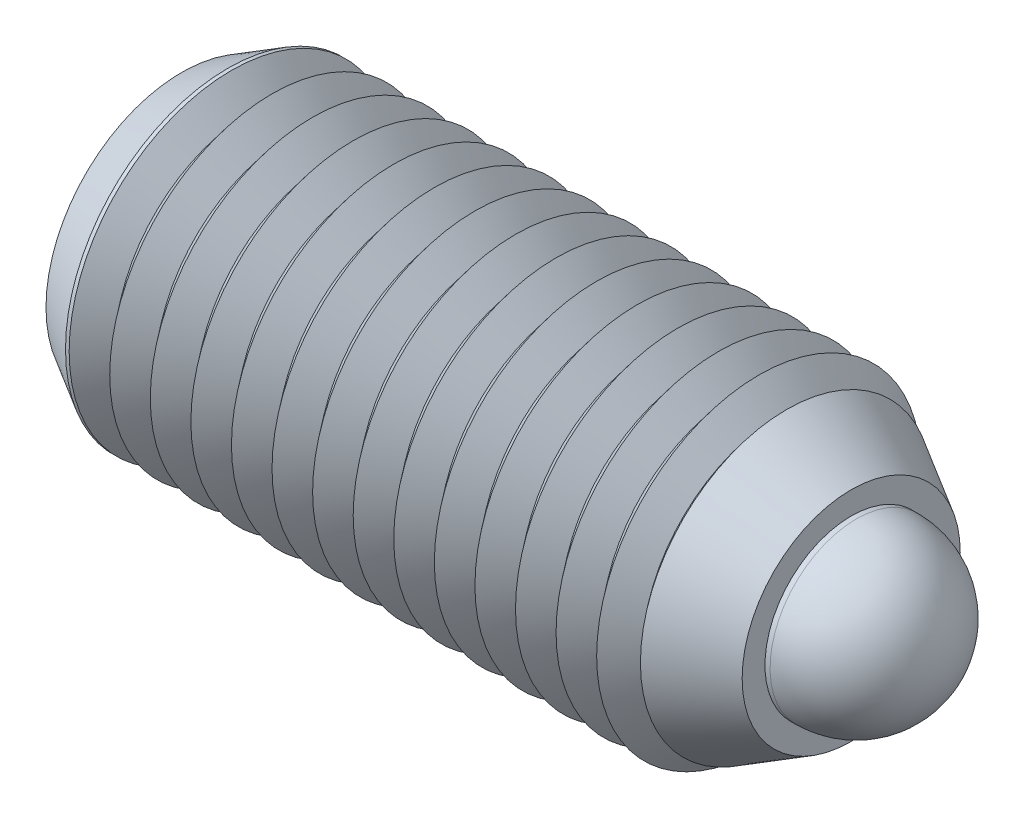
ISO-10303-21;
HEADER;
FILE_DESCRIPTION(('STEP AP214'),'2;1');
FILE_NAME('part.step','',(''),(''),'','','');
FILE_SCHEMA(('AUTOMOTIVE_DESIGN { 1 0 10303 214 1 1 1 1 }'));
ENDSEC;
DATA;
#1=APPLICATION_CONTEXT('core data for automotive mechanical design processes');
#2=APPLICATION_PROTOCOL_DEFINITION('international standard','automotive_design',2000,#1);
#3=PRODUCT_CONTEXT('',#1,'mechanical');
#4=PRODUCT('Part','Part','',(#3));
#5=PRODUCT_RELATED_PRODUCT_CATEGORY('part','',(#4));
#6=PRODUCT_DEFINITION_FORMATION('','',#4);
#7=PRODUCT_DEFINITION_CONTEXT('part definition',#1,'design');
#8=PRODUCT_DEFINITION('design','',#6,#7);
#9=PRODUCT_DEFINITION_SHAPE('','',#8);
#10=(LENGTH_UNIT() NAMED_UNIT(*) SI_UNIT(.MILLI.,.METRE.));
#11=(NAMED_UNIT(*) PLANE_ANGLE_UNIT() SI_UNIT($,.RADIAN.));
#12=(NAMED_UNIT(*) SI_UNIT($,.STERADIAN.) SOLID_ANGLE_UNIT());
#13=UNCERTAINTY_MEASURE_WITH_UNIT(LENGTH_MEASURE(1.E-05),#10,'distance_accuracy_value','');
#14=(GEOMETRIC_REPRESENTATION_CONTEXT(3) GLOBAL_UNCERTAINTY_ASSIGNED_CONTEXT((#13)) GLOBAL_UNIT_ASSIGNED_CONTEXT((#10,
#11,#12)) REPRESENTATION_CONTEXT('',''));
#15=CARTESIAN_POINT('',(0.,0.,0.));
#16=DIRECTION('',(0.,0.,1.));
#17=DIRECTION('',(1.,0.,0.));
#18=AXIS2_PLACEMENT_3D('',#15,#16,#17);
#19=CARTESIAN_POINT('',(30.45,0.,0.));
#20=DIRECTION('',(-1.,0.,0.));
#21=DIRECTION('',(0.,0.,1.));
#22=AXIS2_PLACEMENT_3D('',#19,#20,#21);
#23=CYLINDRICAL_SURFACE('',#22,5.95);
#24=CARTESIAN_POINT('',(25.17,0.,0.));
#25=DIRECTION('',(1.,0.,0.));
#26=DIRECTION('',(0.,0.,-1.));
#27=AXIS2_PLACEMENT_3D('',#24,#25,#26);
#28=CIRCLE('',#27,5.95);
#29=CARTESIAN_POINT('',(25.17,0.,-5.95));
#30=VERTEX_POINT('',#29);
#31=EDGE_CURVE('P0_E21',#30,#30,#28,.T.);
#32=ORIENTED_EDGE('',*,*,#31,.T.);
#33=EDGE_LOOP('',(#32));
#34=FACE_BOUND('',#33,.T.);
#35=CARTESIAN_POINT('',(28.75,0.,0.));
#36=DIRECTION('',(1.,0.,0.));
#37=DIRECTION('',(0.,0.,-1.));
#38=AXIS2_PLACEMENT_3D('',#35,#36,#37);
#39=CIRCLE('',#38,5.95);
#40=CARTESIAN_POINT('',(28.75,0.,-5.95));
#41=VERTEX_POINT('',#40);
#42=EDGE_CURVE('P0_E25',#41,#41,#39,.F.);
#43=ORIENTED_EDGE('',*,*,#42,.T.);
#44=EDGE_LOOP('',(#43));
#45=FACE_BOUND('',#44,.T.);
#46=ADVANCED_FACE('P0_F14',(#34,#45),#23,.T.);
#47=CARTESIAN_POINT('',(23.85,0.,0.));
#48=DIRECTION('',(1.,0.,0.));
#49=DIRECTION('',(0.,0.,-1.));
#50=AXIS2_PLACEMENT_3D('',#47,#48,#49);
#51=PLANE('',#50);
#52=CARTESIAN_POINT('',(23.85,0.,0.));
#53=DIRECTION('',(1.,0.,0.));
#54=DIRECTION('',(0.,0.,-1.));
#55=AXIS2_PLACEMENT_3D('',#52,#53,#54);
#56=CIRCLE('',#55,5.59630706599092);
#57=CARTESIAN_POINT('',(23.85,0.,-5.59630706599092));
#58=VERTEX_POINT('',#57);
#59=EDGE_CURVE('P0_E10',#58,#58,#56,.F.);
#60=ORIENTED_EDGE('',*,*,#59,.T.);
#61=EDGE_LOOP('',(#60));
#62=FACE_BOUND('',#61,.T.);
#63=ADVANCED_FACE('P0_F43',(#62),#51,.F.);
#64=CARTESIAN_POINT('',(33.25,0.,0.));
#65=DIRECTION('',(-1.,0.,0.));
#66=DIRECTION('',(0.,0.,1.));
#67=AXIS2_PLACEMENT_3D('',#64,#65,#66);
#68=CYLINDRICAL_SURFACE('',#67,4.25);
#69=CARTESIAN_POINT('',(33.25,0.,0.));
#70=DIRECTION('',(1.,0.,0.));
#71=DIRECTION('',(0.,0.,-1.));
#72=AXIS2_PLACEMENT_3D('',#69,#70,#71);
#73=CIRCLE('',#72,4.25);
#74=CARTESIAN_POINT('',(33.25,0.,-4.25));
#75=VERTEX_POINT('',#74);
#76=EDGE_CURVE('P0_E29',#75,#75,#73,.T.);
#77=ORIENTED_EDGE('',*,*,#76,.F.);
#78=EDGE_LOOP('',(#77));
#79=FACE_BOUND('',#78,.T.);
#80=CARTESIAN_POINT('',(30.45,0.,0.));
#81=DIRECTION('',(1.,0.,0.));
#82=DIRECTION('',(0.,0.,-1.));
#83=AXIS2_PLACEMENT_3D('',#80,#81,#82);
#84=CIRCLE('',#83,4.25);
#85=CARTESIAN_POINT('',(30.45,0.,-4.25));
#86=VERTEX_POINT('',#85);
#87=EDGE_CURVE('P0_E32',#86,#86,#84,.T.);
#88=ORIENTED_EDGE('',*,*,#87,.T.);
#89=EDGE_LOOP('',(#88));
#90=FACE_BOUND('',#89,.T.);
#91=ADVANCED_FACE('P0_F40',(#79,#90),#68,.T.);
#92=CARTESIAN_POINT('',(33.25,0.,0.));
#93=DIRECTION('',(-1.,0.,0.));
#94=DIRECTION('',(0.,1.,0.));
#95=AXIS2_PLACEMENT_3D('',#92,#93,#94);
#96=SPHERICAL_SURFACE('',#95,4.25);
#97=ORIENTED_EDGE('',*,*,#76,.T.);
#98=EDGE_LOOP('',(#97));
#99=FACE_BOUND('',#98,.T.);
#100=ADVANCED_FACE('P0_F38',(#99),#96,.T.);
#101=CARTESIAN_POINT('',(30.45,0.,0.));
#102=DIRECTION('',(-1.,0.,0.));
#103=DIRECTION('',(0.,0.,1.));
#104=AXIS2_PLACEMENT_3D('',#101,#102,#103);
#105=CONICAL_SURFACE('',#104,4.25,0.785398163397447);
#106=ORIENTED_EDGE('',*,*,#42,.F.);
#107=EDGE_LOOP('',(#106));
#108=FACE_BOUND('',#107,.T.);
#109=ORIENTED_EDGE('',*,*,#87,.F.);
#110=EDGE_LOOP('',(#109));
#111=FACE_BOUND('',#110,.T.);
#112=ADVANCED_FACE('P0_F47',(#108,#111),#105,.T.);
#113=CARTESIAN_POINT('',(25.17,0.,0.));
#114=DIRECTION('',(1.,0.,0.));
#115=DIRECTION('',(0.,0.,-1.));
#116=AXIS2_PLACEMENT_3D('',#113,#114,#115);
#117=CONICAL_SURFACE('',#116,5.95,0.261799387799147);
#118=ORIENTED_EDGE('',*,*,#59,.F.);
#119=EDGE_LOOP('',(#118));
#120=FACE_BOUND('',#119,.T.);
#121=ORIENTED_EDGE('',*,*,#31,.F.);
#122=EDGE_LOOP('',(#121));
#123=FACE_BOUND('',#122,.T.);
#124=ADVANCED_FACE('P0_F16',(#120,#123),#117,.T.);
#125=CLOSED_SHELL('',(#46,#63,#91,#100,#112,#124));
#126=MANIFOLD_SOLID_BREP('P0_B1',#125);
#127=CARTESIAN_POINT('',(33.,0.,0.));
#128=DIRECTION('',(-1.,0.,0.));
#129=DIRECTION('',(0.,0.,1.));
#130=AXIS2_PLACEMENT_3D('',#127,#128,#129);
#131=CONICAL_SURFACE('',#130,5.375,0.523598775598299);
#132=CARTESIAN_POINT('',(33.,0.,0.));
#133=DIRECTION('',(1.,0.,0.));
#134=DIRECTION('',(0.,0.,-1.));
#135=AXIS2_PLACEMENT_3D('',#132,#133,#134);
#136=CIRCLE('',#135,5.375);
#137=CARTESIAN_POINT('',(33.,0.,-5.375));
#138=VERTEX_POINT('',#137);
#139=EDGE_CURVE('P1_E328',#138,#138,#136,.T.);
#140=ORIENTED_EDGE('',*,*,#139,.F.);
#141=EDGE_LOOP('',(#140));
#142=FACE_BOUND('',#141,.T.);
#143=CARTESIAN_POINT('',(29.8211216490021,0.,0.));
#144=DIRECTION('',(1.,0.,0.));
#145=DIRECTION('',(0.,0.,-1.));
#146=AXIS2_PLACEMENT_3D('',#143,#144,#145);
#147=CIRCLE('',#146,7.21032627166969);
#148=CARTESIAN_POINT('',(29.8211216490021,0.,-7.21032627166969));
#149=VERTEX_POINT('',#148);
#150=EDGE_CURVE('P1_E333',#149,#149,#147,.T.);
#151=ORIENTED_EDGE('',*,*,#150,.T.);
#152=EDGE_LOOP('',(#151));
#153=FACE_BOUND('',#152,.T.);
#154=ADVANCED_FACE('P1_F15',(#142,#153),#131,.T.);
#155=CARTESIAN_POINT('',(33.,0.,0.));
#156=DIRECTION('',(1.,0.,0.));
#157=DIRECTION('',(0.,0.,-1.));
#158=AXIS2_PLACEMENT_3D('',#155,#156,#157);
#159=PLANE('',#158);
#160=ORIENTED_EDGE('',*,*,#139,.T.);
#161=EDGE_LOOP('',(#160));
#162=FACE_BOUND('',#161,.T.);
#163=CARTESIAN_POINT('',(33.,0.,0.));
#164=DIRECTION('',(1.,0.,0.));
#165=DIRECTION('',(0.,0.,-1.));
#166=AXIS2_PLACEMENT_3D('',#163,#164,#165);
#167=CIRCLE('',#166,4.25);
#168=CARTESIAN_POINT('',(33.,0.,-4.25));
#169=VERTEX_POINT('',#168);
#170=EDGE_CURVE('P1_E336',#169,#169,#167,.T.);
#171=ORIENTED_EDGE('',*,*,#170,.F.);
#172=EDGE_LOOP('',(#171));
#173=FACE_BOUND('',#172,.T.);
#174=ADVANCED_FACE('P1_F188',(#162,#173),#159,.T.);
#175=CARTESIAN_POINT('',(9.9,0.,0.));
#176=DIRECTION('',(-1.,0.,0.));
#177=DIRECTION('',(0.,0.,1.));
#178=AXIS2_PLACEMENT_3D('',#175,#176,#177);
#179=PLANE('',#178);
#180=CARTESIAN_POINT('',(9.9,0.,0.));
#181=DIRECTION('',(1.,0.,0.));
#182=DIRECTION('',(0.,0.,-1.));
#183=AXIS2_PLACEMENT_3D('',#180,#181,#182);
#184=CIRCLE('',#183,5.95);
#185=CARTESIAN_POINT('',(9.9,0.,-5.95));
#186=VERTEX_POINT('',#185);
#187=EDGE_CURVE('P1_E442',#186,#186,#184,.T.);
#188=ORIENTED_EDGE('',*,*,#187,.T.);
#189=EDGE_LOOP('',(#188));
#190=FACE_BOUND('',#189,.T.);
#191=ADVANCED_FACE('P1_F194',(#190),#179,.F.);
#192=CARTESIAN_POINT('',(33.,0.,0.));
#193=DIRECTION('',(1.,0.,0.));
#194=DIRECTION('',(0.,0.,-1.));
#195=AXIS2_PLACEMENT_3D('',#192,#193,#194);
#196=CYLINDRICAL_SURFACE('',#195,5.95);
#197=ORIENTED_EDGE('',*,*,#187,.F.);
#198=EDGE_LOOP('',(#197));
#199=FACE_BOUND('',#198,.T.);
#200=CARTESIAN_POINT('',(29.7,0.,0.));
#201=DIRECTION('',(1.,0.,0.));
#202=DIRECTION('',(0.,0.,-1.));
#203=AXIS2_PLACEMENT_3D('',#200,#201,#202);
#204=CIRCLE('',#203,5.95);
#205=CARTESIAN_POINT('',(29.7,0.,-5.95));
#206=VERTEX_POINT('',#205);
#207=EDGE_CURVE('P1_E440',#206,#206,#204,.T.);
#208=ORIENTED_EDGE('',*,*,#207,.T.);
#209=EDGE_LOOP('',(#208));
#210=FACE_BOUND('',#209,.T.);
#211=ADVANCED_FACE('P1_F478',(#199,#210),#196,.F.);
#212=CARTESIAN_POINT('',(33.,0.,0.));
#213=DIRECTION('',(-1.,0.,0.));
#214=DIRECTION('',(0.,0.,1.));
#215=AXIS2_PLACEMENT_3D('',#212,#213,#214);
#216=CONICAL_SURFACE('',#215,4.25,0.475695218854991);
#217=ORIENTED_EDGE('',*,*,#207,.F.);
#218=EDGE_LOOP('',(#217));
#219=FACE_BOUND('',#218,.T.);
#220=ORIENTED_EDGE('',*,*,#170,.T.);
#221=EDGE_LOOP('',(#220));
#222=FACE_BOUND('',#221,.T.);
#223=ADVANCED_FACE('P1_F484',(#219,#222),#216,.F.);
#224=CARTESIAN_POINT('',(29.4533666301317,0.,0.));
#225=DIRECTION('',(1.,0.,0.));
#226=DIRECTION('',(0.,0.,-1.));
#227=AXIS2_PLACEMENT_3D('',#224,#225,#226);
#228=CONICAL_SURFACE('',#227,6.75100040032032,0.895664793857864);
#229=ORIENTED_EDGE('',*,*,#150,.F.);
#230=EDGE_LOOP('',(#229));
#231=FACE_BOUND('',#230,.T.);
#232=CARTESIAN_POINT('',(29.4533666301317,0.,0.));
#233=DIRECTION('',(-1.,0.,0.));
#234=DIRECTION('',(0.,0.,1.));
#235=AXIS2_PLACEMENT_3D('',#232,#233,#234);
#236=CIRCLE('',#235,6.75100040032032);
#237=CARTESIAN_POINT('',(29.4533666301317,0.,6.75100040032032));
#238=VERTEX_POINT('',#237);
#239=EDGE_CURVE('P1_E337',#238,#238,#236,.T.);
#240=ORIENTED_EDGE('',*,*,#239,.F.);
#241=EDGE_LOOP('',(#240));
#242=FACE_BOUND('',#241,.T.);
#243=ADVANCED_FACE('P1_F491',(#231,#242),#228,.T.);
#244=CARTESIAN_POINT('',(28.4533666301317,0.,0.));
#245=DIRECTION('',(-1.,0.,0.));
#246=DIRECTION('',(0.,0.,1.));
#247=AXIS2_PLACEMENT_3D('',#244,#245,#246);
#248=CONICAL_SURFACE('',#247,8.,0.895664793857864);
#249=ORIENTED_EDGE('',*,*,#239,.T.);
#250=EDGE_LOOP('',(#249));
#251=FACE_BOUND('',#250,.T.);
#252=CARTESIAN_POINT('',(28.4533666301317,0.,0.));
#253=DIRECTION('',(-1.,0.,0.));
#254=DIRECTION('',(0.,0.,1.));
#255=AXIS2_PLACEMENT_3D('',#252,#253,#254);
#256=CIRCLE('',#255,8.);
#257=CARTESIAN_POINT('',(28.4533666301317,0.,8.));
#258=VERTEX_POINT('',#257);
#259=EDGE_CURVE('P1_E433',#258,#258,#256,.T.);
#260=ORIENTED_EDGE('',*,*,#259,.F.);
#261=EDGE_LOOP('',(#260));
#262=FACE_BOUND('',#261,.T.);
#263=ADVANCED_FACE('P1_F499',(#251,#262),#248,.T.);
#264=CARTESIAN_POINT('',(27.4533666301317,0.,0.));
#265=DIRECTION('',(1.,0.,0.));
#266=DIRECTION('',(0.,0.,-1.));
#267=AXIS2_PLACEMENT_3D('',#264,#265,#266);
#268=CONICAL_SURFACE('',#267,6.75100040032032,0.895664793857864);
#269=ORIENTED_EDGE('',*,*,#259,.T.);
#270=EDGE_LOOP('',(#269));
#271=FACE_BOUND('',#270,.T.);
#272=CARTESIAN_POINT('',(27.4533666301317,0.,0.));
#273=DIRECTION('',(-1.,0.,0.));
#274=DIRECTION('',(0.,0.,1.));
#275=AXIS2_PLACEMENT_3D('',#272,#273,#274);
#276=CIRCLE('',#275,6.75100040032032);
#277=CARTESIAN_POINT('',(27.4533666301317,0.,6.75100040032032));
#278=VERTEX_POINT('',#277);
#279=EDGE_CURVE('P1_E430',#278,#278,#276,.T.);
#280=ORIENTED_EDGE('',*,*,#279,.F.);
#281=EDGE_LOOP('',(#280));
#282=FACE_BOUND('',#281,.T.);
#283=ADVANCED_FACE('P1_F507',(#271,#282),#268,.T.);
#284=CARTESIAN_POINT('',(26.4533666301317,0.,0.));
#285=DIRECTION('',(-1.,0.,0.));
#286=DIRECTION('',(0.,0.,1.));
#287=AXIS2_PLACEMENT_3D('',#284,#285,#286);
#288=CONICAL_SURFACE('',#287,8.,0.895664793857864);
#289=ORIENTED_EDGE('',*,*,#279,.T.);
#290=EDGE_LOOP('',(#289));
#291=FACE_BOUND('',#290,.T.);
#292=CARTESIAN_POINT('',(26.4533666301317,0.,0.));
#293=DIRECTION('',(-1.,0.,0.));
#294=DIRECTION('',(0.,0.,1.));
#295=AXIS2_PLACEMENT_3D('',#292,#293,#294);
#296=CIRCLE('',#295,8.);
#297=CARTESIAN_POINT('',(26.4533666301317,0.,8.));
#298=VERTEX_POINT('',#297);
#299=EDGE_CURVE('P1_E427',#298,#298,#296,.T.);
#300=ORIENTED_EDGE('',*,*,#299,.F.);
#301=EDGE_LOOP('',(#300));
#302=FACE_BOUND('',#301,.T.);
#303=ADVANCED_FACE('P1_F515',(#291,#302),#288,.T.);
#304=CARTESIAN_POINT('',(25.4533666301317,0.,0.));
#305=DIRECTION('',(1.,0.,0.));
#306=DIRECTION('',(0.,0.,-1.));
#307=AXIS2_PLACEMENT_3D('',#304,#305,#306);
#308=CONICAL_SURFACE('',#307,6.75100040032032,0.895664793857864);
#309=ORIENTED_EDGE('',*,*,#299,.T.);
#310=EDGE_LOOP('',(#309));
#311=FACE_BOUND('',#310,.T.);
#312=CARTESIAN_POINT('',(25.4533666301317,0.,0.));
#313=DIRECTION('',(-1.,0.,0.));
#314=DIRECTION('',(0.,0.,1.));
#315=AXIS2_PLACEMENT_3D('',#312,#313,#314);
#316=CIRCLE('',#315,6.75100040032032);
#317=CARTESIAN_POINT('',(25.4533666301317,0.,6.75100040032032));
#318=VERTEX_POINT('',#317);
#319=EDGE_CURVE('P1_E424',#318,#318,#316,.T.);
#320=ORIENTED_EDGE('',*,*,#319,.F.);
#321=EDGE_LOOP('',(#320));
#322=FACE_BOUND('',#321,.T.);
#323=ADVANCED_FACE('P1_F523',(#311,#322),#308,.T.);
#324=CARTESIAN_POINT('',(24.4533666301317,0.,0.));
#325=DIRECTION('',(-1.,0.,0.));
#326=DIRECTION('',(0.,0.,1.));
#327=AXIS2_PLACEMENT_3D('',#324,#325,#326);
#328=CONICAL_SURFACE('',#327,8.,0.895664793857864);
#329=ORIENTED_EDGE('',*,*,#319,.T.);
#330=EDGE_LOOP('',(#329));
#331=FACE_BOUND('',#330,.T.);
#332=CARTESIAN_POINT('',(24.4533666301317,0.,0.));
#333=DIRECTION('',(-1.,0.,0.));
#334=DIRECTION('',(0.,0.,1.));
#335=AXIS2_PLACEMENT_3D('',#332,#333,#334);
#336=CIRCLE('',#335,8.);
#337=CARTESIAN_POINT('',(24.4533666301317,0.,8.));
#338=VERTEX_POINT('',#337);
#339=EDGE_CURVE('P1_E421',#338,#338,#336,.T.);
#340=ORIENTED_EDGE('',*,*,#339,.F.);
#341=EDGE_LOOP('',(#340));
#342=FACE_BOUND('',#341,.T.);
#343=ADVANCED_FACE('P1_F531',(#331,#342),#328,.T.);
#344=CARTESIAN_POINT('',(23.4533666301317,0.,0.));
#345=DIRECTION('',(1.,0.,0.));
#346=DIRECTION('',(0.,0.,-1.));
#347=AXIS2_PLACEMENT_3D('',#344,#345,#346);
#348=CONICAL_SURFACE('',#347,6.75100040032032,0.895664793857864);
#349=ORIENTED_EDGE('',*,*,#339,.T.);
#350=EDGE_LOOP('',(#349));
#351=FACE_BOUND('',#350,.T.);
#352=CARTESIAN_POINT('',(23.4533666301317,0.,0.));
#353=DIRECTION('',(-1.,0.,0.));
#354=DIRECTION('',(0.,0.,1.));
#355=AXIS2_PLACEMENT_3D('',#352,#353,#354);
#356=CIRCLE('',#355,6.75100040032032);
#357=CARTESIAN_POINT('',(23.4533666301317,0.,6.75100040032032));
#358=VERTEX_POINT('',#357);
#359=EDGE_CURVE('P1_E418',#358,#358,#356,.T.);
#360=ORIENTED_EDGE('',*,*,#359,.F.);
#361=EDGE_LOOP('',(#360));
#362=FACE_BOUND('',#361,.T.);
#363=ADVANCED_FACE('P1_F539',(#351,#362),#348,.T.);
#364=CARTESIAN_POINT('',(22.4533666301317,0.,0.));
#365=DIRECTION('',(-1.,0.,0.));
#366=DIRECTION('',(0.,0.,1.));
#367=AXIS2_PLACEMENT_3D('',#364,#365,#366);
#368=CONICAL_SURFACE('',#367,8.,0.895664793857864);
#369=ORIENTED_EDGE('',*,*,#359,.T.);
#370=EDGE_LOOP('',(#369));
#371=FACE_BOUND('',#370,.T.);
#372=CARTESIAN_POINT('',(22.4533666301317,0.,0.));
#373=DIRECTION('',(-1.,0.,0.));
#374=DIRECTION('',(0.,0.,1.));
#375=AXIS2_PLACEMENT_3D('',#372,#373,#374);
#376=CIRCLE('',#375,8.);
#377=CARTESIAN_POINT('',(22.4533666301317,0.,8.));
#378=VERTEX_POINT('',#377);
#379=EDGE_CURVE('P1_E415',#378,#378,#376,.T.);
#380=ORIENTED_EDGE('',*,*,#379,.F.);
#381=EDGE_LOOP('',(#380));
#382=FACE_BOUND('',#381,.T.);
#383=ADVANCED_FACE('P1_F547',(#371,#382),#368,.T.);
#384=CARTESIAN_POINT('',(21.4533666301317,0.,0.));
#385=DIRECTION('',(1.,0.,0.));
#386=DIRECTION('',(0.,0.,-1.));
#387=AXIS2_PLACEMENT_3D('',#384,#385,#386);
#388=CONICAL_SURFACE('',#387,6.75100040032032,0.895664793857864);
#389=ORIENTED_EDGE('',*,*,#379,.T.);
#390=EDGE_LOOP('',(#389));
#391=FACE_BOUND('',#390,.T.);
#392=CARTESIAN_POINT('',(21.4533666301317,0.,0.));
#393=DIRECTION('',(-1.,0.,0.));
#394=DIRECTION('',(0.,0.,1.));
#395=AXIS2_PLACEMENT_3D('',#392,#393,#394);
#396=CIRCLE('',#395,6.75100040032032);
#397=CARTESIAN_POINT('',(21.4533666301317,0.,6.75100040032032));
#398=VERTEX_POINT('',#397);
#399=EDGE_CURVE('P1_E412',#398,#398,#396,.T.);
#400=ORIENTED_EDGE('',*,*,#399,.F.);
#401=EDGE_LOOP('',(#400));
#402=FACE_BOUND('',#401,.T.);
#403=ADVANCED_FACE('P1_F555',(#391,#402),#388,.T.);
#404=CARTESIAN_POINT('',(20.4533666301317,0.,0.));
#405=DIRECTION('',(-1.,0.,0.));
#406=DIRECTION('',(0.,0.,1.));
#407=AXIS2_PLACEMENT_3D('',#404,#405,#406);
#408=CONICAL_SURFACE('',#407,8.,0.895664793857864);
#409=ORIENTED_EDGE('',*,*,#399,.T.);
#410=EDGE_LOOP('',(#409));
#411=FACE_BOUND('',#410,.T.);
#412=CARTESIAN_POINT('',(20.4533666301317,0.,0.));
#413=DIRECTION('',(-1.,0.,0.));
#414=DIRECTION('',(0.,0.,1.));
#415=AXIS2_PLACEMENT_3D('',#412,#413,#414);
#416=CIRCLE('',#415,8.);
#417=CARTESIAN_POINT('',(20.4533666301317,0.,8.));
#418=VERTEX_POINT('',#417);
#419=EDGE_CURVE('P1_E409',#418,#418,#416,.T.);
#420=ORIENTED_EDGE('',*,*,#419,.F.);
#421=EDGE_LOOP('',(#420));
#422=FACE_BOUND('',#421,.T.);
#423=ADVANCED_FACE('P1_F563',(#411,#422),#408,.T.);
#424=CARTESIAN_POINT('',(19.4533666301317,0.,0.));
#425=DIRECTION('',(1.,0.,0.));
#426=DIRECTION('',(0.,0.,-1.));
#427=AXIS2_PLACEMENT_3D('',#424,#425,#426);
#428=CONICAL_SURFACE('',#427,6.75100040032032,0.895664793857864);
#429=ORIENTED_EDGE('',*,*,#419,.T.);
#430=EDGE_LOOP('',(#429));
#431=FACE_BOUND('',#430,.T.);
#432=CARTESIAN_POINT('',(19.4533666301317,0.,0.));
#433=DIRECTION('',(-1.,0.,0.));
#434=DIRECTION('',(0.,0.,1.));
#435=AXIS2_PLACEMENT_3D('',#432,#433,#434);
#436=CIRCLE('',#435,6.75100040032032);
#437=CARTESIAN_POINT('',(19.4533666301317,0.,6.75100040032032));
#438=VERTEX_POINT('',#437);
#439=EDGE_CURVE('P1_E406',#438,#438,#436,.T.);
#440=ORIENTED_EDGE('',*,*,#439,.F.);
#441=EDGE_LOOP('',(#440));
#442=FACE_BOUND('',#441,.T.);
#443=ADVANCED_FACE('P1_F571',(#431,#442),#428,.T.);
#444=CARTESIAN_POINT('',(18.4533666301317,0.,0.));
#445=DIRECTION('',(-1.,0.,0.));
#446=DIRECTION('',(0.,0.,1.));
#447=AXIS2_PLACEMENT_3D('',#444,#445,#446);
#448=CONICAL_SURFACE('',#447,8.,0.895664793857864);
#449=ORIENTED_EDGE('',*,*,#439,.T.);
#450=EDGE_LOOP('',(#449));
#451=FACE_BOUND('',#450,.T.);
#452=CARTESIAN_POINT('',(18.4533666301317,0.,0.));
#453=DIRECTION('',(-1.,0.,0.));
#454=DIRECTION('',(0.,0.,1.));
#455=AXIS2_PLACEMENT_3D('',#452,#453,#454);
#456=CIRCLE('',#455,8.);
#457=CARTESIAN_POINT('',(18.4533666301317,0.,8.));
#458=VERTEX_POINT('',#457);
#459=EDGE_CURVE('P1_E403',#458,#458,#456,.T.);
#460=ORIENTED_EDGE('',*,*,#459,.F.);
#461=EDGE_LOOP('',(#460));
#462=FACE_BOUND('',#461,.T.);
#463=ADVANCED_FACE('P1_F579',(#451,#462),#448,.T.);
#464=CARTESIAN_POINT('',(17.4533666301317,0.,0.));
#465=DIRECTION('',(1.,0.,0.));
#466=DIRECTION('',(0.,0.,-1.));
#467=AXIS2_PLACEMENT_3D('',#464,#465,#466);
#468=CONICAL_SURFACE('',#467,6.75100040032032,0.895664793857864);
#469=ORIENTED_EDGE('',*,*,#459,.T.);
#470=EDGE_LOOP('',(#469));
#471=FACE_BOUND('',#470,.T.);
#472=CARTESIAN_POINT('',(17.4533666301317,0.,0.));
#473=DIRECTION('',(-1.,0.,0.));
#474=DIRECTION('',(0.,0.,1.));
#475=AXIS2_PLACEMENT_3D('',#472,#473,#474);
#476=CIRCLE('',#475,6.75100040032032);
#477=CARTESIAN_POINT('',(17.4533666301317,0.,6.75100040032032));
#478=VERTEX_POINT('',#477);
#479=EDGE_CURVE('P1_E400',#478,#478,#476,.T.);
#480=ORIENTED_EDGE('',*,*,#479,.F.);
#481=EDGE_LOOP('',(#480));
#482=FACE_BOUND('',#481,.T.);
#483=ADVANCED_FACE('P1_F587',(#471,#482),#468,.T.);
#484=CARTESIAN_POINT('',(16.4533666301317,0.,0.));
#485=DIRECTION('',(-1.,0.,0.));
#486=DIRECTION('',(0.,0.,1.));
#487=AXIS2_PLACEMENT_3D('',#484,#485,#486);
#488=CONICAL_SURFACE('',#487,8.,0.895664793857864);
#489=ORIENTED_EDGE('',*,*,#479,.T.);
#490=EDGE_LOOP('',(#489));
#491=FACE_BOUND('',#490,.T.);
#492=CARTESIAN_POINT('',(16.4533666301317,0.,0.));
#493=DIRECTION('',(-1.,0.,0.));
#494=DIRECTION('',(0.,0.,1.));
#495=AXIS2_PLACEMENT_3D('',#492,#493,#494);
#496=CIRCLE('',#495,8.);
#497=CARTESIAN_POINT('',(16.4533666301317,0.,8.));
#498=VERTEX_POINT('',#497);
#499=EDGE_CURVE('P1_E397',#498,#498,#496,.T.);
#500=ORIENTED_EDGE('',*,*,#499,.F.);
#501=EDGE_LOOP('',(#500));
#502=FACE_BOUND('',#501,.T.);
#503=ADVANCED_FACE('P1_F595',(#491,#502),#488,.T.);
#504=CARTESIAN_POINT('',(15.4533666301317,0.,0.));
#505=DIRECTION('',(1.,0.,0.));
#506=DIRECTION('',(0.,0.,-1.));
#507=AXIS2_PLACEMENT_3D('',#504,#505,#506);
#508=CONICAL_SURFACE('',#507,6.75100040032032,0.895664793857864);
#509=ORIENTED_EDGE('',*,*,#499,.T.);
#510=EDGE_LOOP('',(#509));
#511=FACE_BOUND('',#510,.T.);
#512=CARTESIAN_POINT('',(15.4533666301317,0.,0.));
#513=DIRECTION('',(-1.,0.,0.));
#514=DIRECTION('',(0.,0.,1.));
#515=AXIS2_PLACEMENT_3D('',#512,#513,#514);
#516=CIRCLE('',#515,6.75100040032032);
#517=CARTESIAN_POINT('',(15.4533666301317,0.,6.75100040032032));
#518=VERTEX_POINT('',#517);
#519=EDGE_CURVE('P1_E394',#518,#518,#516,.T.);
#520=ORIENTED_EDGE('',*,*,#519,.F.);
#521=EDGE_LOOP('',(#520));
#522=FACE_BOUND('',#521,.T.);
#523=ADVANCED_FACE('P1_F603',(#511,#522),#508,.T.);
#524=CARTESIAN_POINT('',(14.4533666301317,0.,0.));
#525=DIRECTION('',(-1.,0.,0.));
#526=DIRECTION('',(0.,0.,1.));
#527=AXIS2_PLACEMENT_3D('',#524,#525,#526);
#528=CONICAL_SURFACE('',#527,8.,0.895664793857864);
#529=ORIENTED_EDGE('',*,*,#519,.T.);
#530=EDGE_LOOP('',(#529));
#531=FACE_BOUND('',#530,.T.);
#532=CARTESIAN_POINT('',(14.4533666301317,0.,0.));
#533=DIRECTION('',(-1.,0.,0.));
#534=DIRECTION('',(0.,0.,1.));
#535=AXIS2_PLACEMENT_3D('',#532,#533,#534);
#536=CIRCLE('',#535,8.);
#537=CARTESIAN_POINT('',(14.4533666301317,0.,8.));
#538=VERTEX_POINT('',#537);
#539=EDGE_CURVE('P1_E391',#538,#538,#536,.T.);
#540=ORIENTED_EDGE('',*,*,#539,.F.);
#541=EDGE_LOOP('',(#540));
#542=FACE_BOUND('',#541,.T.);
#543=ADVANCED_FACE('P1_F611',(#531,#542),#528,.T.);
#544=CARTESIAN_POINT('',(13.4533666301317,0.,0.));
#545=DIRECTION('',(1.,0.,0.));
#546=DIRECTION('',(0.,0.,-1.));
#547=AXIS2_PLACEMENT_3D('',#544,#545,#546);
#548=CONICAL_SURFACE('',#547,6.75100040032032,0.895664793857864);
#549=ORIENTED_EDGE('',*,*,#539,.T.);
#550=EDGE_LOOP('',(#549));
#551=FACE_BOUND('',#550,.T.);
#552=CARTESIAN_POINT('',(13.4533666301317,0.,0.));
#553=DIRECTION('',(-1.,0.,0.));
#554=DIRECTION('',(0.,0.,1.));
#555=AXIS2_PLACEMENT_3D('',#552,#553,#554);
#556=CIRCLE('',#555,6.75100040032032);
#557=CARTESIAN_POINT('',(13.4533666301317,0.,6.75100040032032));
#558=VERTEX_POINT('',#557);
#559=EDGE_CURVE('P1_E388',#558,#558,#556,.T.);
#560=ORIENTED_EDGE('',*,*,#559,.F.);
#561=EDGE_LOOP('',(#560));
#562=FACE_BOUND('',#561,.T.);
#563=ADVANCED_FACE('P1_F619',(#551,#562),#548,.T.);
#564=CARTESIAN_POINT('',(12.4533666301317,0.,0.));
#565=DIRECTION('',(-1.,0.,0.));
#566=DIRECTION('',(0.,0.,1.));
#567=AXIS2_PLACEMENT_3D('',#564,#565,#566);
#568=CONICAL_SURFACE('',#567,8.,0.895664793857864);
#569=ORIENTED_EDGE('',*,*,#559,.T.);
#570=EDGE_LOOP('',(#569));
#571=FACE_BOUND('',#570,.T.);
#572=CARTESIAN_POINT('',(12.4533666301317,0.,0.));
#573=DIRECTION('',(-1.,0.,0.));
#574=DIRECTION('',(0.,0.,1.));
#575=AXIS2_PLACEMENT_3D('',#572,#573,#574);
#576=CIRCLE('',#575,8.);
#577=CARTESIAN_POINT('',(12.4533666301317,0.,8.));
#578=VERTEX_POINT('',#577);
#579=EDGE_CURVE('P1_E385',#578,#578,#576,.T.);
#580=ORIENTED_EDGE('',*,*,#579,.F.);
#581=EDGE_LOOP('',(#580));
#582=FACE_BOUND('',#581,.T.);
#583=ADVANCED_FACE('P1_F627',(#571,#582),#568,.T.);
#584=CARTESIAN_POINT('',(11.4533666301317,0.,0.));
#585=DIRECTION('',(1.,0.,0.));
#586=DIRECTION('',(0.,0.,-1.));
#587=AXIS2_PLACEMENT_3D('',#584,#585,#586);
#588=CONICAL_SURFACE('',#587,6.75100040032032,0.895664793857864);
#589=ORIENTED_EDGE('',*,*,#579,.T.);
#590=EDGE_LOOP('',(#589));
#591=FACE_BOUND('',#590,.T.);
#592=CARTESIAN_POINT('',(11.4533666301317,0.,0.));
#593=DIRECTION('',(-1.,0.,0.));
#594=DIRECTION('',(0.,0.,1.));
#595=AXIS2_PLACEMENT_3D('',#592,#593,#594);
#596=CIRCLE('',#595,6.75100040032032);
#597=CARTESIAN_POINT('',(11.4533666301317,0.,6.75100040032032));
#598=VERTEX_POINT('',#597);
#599=EDGE_CURVE('P1_E382',#598,#598,#596,.T.);
#600=ORIENTED_EDGE('',*,*,#599,.F.);
#601=EDGE_LOOP('',(#600));
#602=FACE_BOUND('',#601,.T.);
#603=ADVANCED_FACE('P1_F635',(#591,#602),#588,.T.);
#604=CARTESIAN_POINT('',(10.4533666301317,0.,0.));
#605=DIRECTION('',(-1.,0.,0.));
#606=DIRECTION('',(0.,0.,1.));
#607=AXIS2_PLACEMENT_3D('',#604,#605,#606);
#608=CONICAL_SURFACE('',#607,8.,0.895664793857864);
#609=ORIENTED_EDGE('',*,*,#599,.T.);
#610=EDGE_LOOP('',(#609));
#611=FACE_BOUND('',#610,.T.);
#612=CARTESIAN_POINT('',(10.4533666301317,0.,0.));
#613=DIRECTION('',(-1.,0.,0.));
#614=DIRECTION('',(0.,0.,1.));
#615=AXIS2_PLACEMENT_3D('',#612,#613,#614);
#616=CIRCLE('',#615,8.);
#617=CARTESIAN_POINT('',(10.4533666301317,0.,8.));
#618=VERTEX_POINT('',#617);
#619=EDGE_CURVE('P1_E379',#618,#618,#616,.T.);
#620=ORIENTED_EDGE('',*,*,#619,.F.);
#621=EDGE_LOOP('',(#620));
#622=FACE_BOUND('',#621,.T.);
#623=ADVANCED_FACE('P1_F643',(#611,#622),#608,.T.);
#624=CARTESIAN_POINT('',(9.45336663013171,0.,0.));
#625=DIRECTION('',(1.,0.,0.));
#626=DIRECTION('',(0.,0.,-1.));
#627=AXIS2_PLACEMENT_3D('',#624,#625,#626);
#628=CONICAL_SURFACE('',#627,6.75100040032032,0.895664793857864);
#629=ORIENTED_EDGE('',*,*,#619,.T.);
#630=EDGE_LOOP('',(#629));
#631=FACE_BOUND('',#630,.T.);
#632=CARTESIAN_POINT('',(9.45336663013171,0.,0.));
#633=DIRECTION('',(-1.,0.,0.));
#634=DIRECTION('',(0.,0.,1.));
#635=AXIS2_PLACEMENT_3D('',#632,#633,#634);
#636=CIRCLE('',#635,6.75100040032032);
#637=CARTESIAN_POINT('',(9.45336663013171,0.,6.75100040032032));
#638=VERTEX_POINT('',#637);
#639=EDGE_CURVE('P1_E376',#638,#638,#636,.T.);
#640=ORIENTED_EDGE('',*,*,#639,.F.);
#641=EDGE_LOOP('',(#640));
#642=FACE_BOUND('',#641,.T.);
#643=ADVANCED_FACE('P1_F651',(#631,#642),#628,.T.);
#644=CARTESIAN_POINT('',(8.4533666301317,0.,0.));
#645=DIRECTION('',(-1.,0.,0.));
#646=DIRECTION('',(0.,0.,1.));
#647=AXIS2_PLACEMENT_3D('',#644,#645,#646);
#648=CONICAL_SURFACE('',#647,8.,0.895664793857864);
#649=ORIENTED_EDGE('',*,*,#639,.T.);
#650=EDGE_LOOP('',(#649));
#651=FACE_BOUND('',#650,.T.);
#652=CARTESIAN_POINT('',(8.45336663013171,0.,0.));
#653=DIRECTION('',(-1.,0.,0.));
#654=DIRECTION('',(0.,0.,1.));
#655=AXIS2_PLACEMENT_3D('',#652,#653,#654);
#656=CIRCLE('',#655,8.);
#657=CARTESIAN_POINT('',(8.45336663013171,0.,8.));
#658=VERTEX_POINT('',#657);
#659=EDGE_CURVE('P1_E373',#658,#658,#656,.T.);
#660=ORIENTED_EDGE('',*,*,#659,.F.);
#661=EDGE_LOOP('',(#660));
#662=FACE_BOUND('',#661,.T.);
#663=ADVANCED_FACE('P1_F659',(#651,#662),#648,.T.);
#664=CARTESIAN_POINT('',(7.45336663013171,0.,0.));
#665=DIRECTION('',(1.,0.,0.));
#666=DIRECTION('',(0.,0.,-1.));
#667=AXIS2_PLACEMENT_3D('',#664,#665,#666);
#668=CONICAL_SURFACE('',#667,6.75100040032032,0.895664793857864);
#669=ORIENTED_EDGE('',*,*,#659,.T.);
#670=EDGE_LOOP('',(#669));
#671=FACE_BOUND('',#670,.T.);
#672=CARTESIAN_POINT('',(7.45336663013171,0.,0.));
#673=DIRECTION('',(-1.,0.,0.));
#674=DIRECTION('',(0.,0.,1.));
#675=AXIS2_PLACEMENT_3D('',#672,#673,#674);
#676=CIRCLE('',#675,6.75100040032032);
#677=CARTESIAN_POINT('',(7.45336663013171,0.,6.75100040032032));
#678=VERTEX_POINT('',#677);
#679=EDGE_CURVE('P1_E370',#678,#678,#676,.T.);
#680=ORIENTED_EDGE('',*,*,#679,.F.);
#681=EDGE_LOOP('',(#680));
#682=FACE_BOUND('',#681,.T.);
#683=ADVANCED_FACE('P1_F667',(#671,#682),#668,.T.);
#684=CARTESIAN_POINT('',(6.45336663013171,0.,0.));
#685=DIRECTION('',(-1.,0.,0.));
#686=DIRECTION('',(0.,0.,1.));
#687=AXIS2_PLACEMENT_3D('',#684,#685,#686);
#688=CONICAL_SURFACE('',#687,8.,0.895664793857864);
#689=ORIENTED_EDGE('',*,*,#679,.T.);
#690=EDGE_LOOP('',(#689));
#691=FACE_BOUND('',#690,.T.);
#692=CARTESIAN_POINT('',(6.45336663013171,0.,0.));
#693=DIRECTION('',(-1.,0.,0.));
#694=DIRECTION('',(0.,0.,1.));
#695=AXIS2_PLACEMENT_3D('',#692,#693,#694);
#696=CIRCLE('',#695,8.);
#697=CARTESIAN_POINT('',(6.45336663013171,0.,8.));
#698=VERTEX_POINT('',#697);
#699=EDGE_CURVE('P1_E367',#698,#698,#696,.T.);
#700=ORIENTED_EDGE('',*,*,#699,.F.);
#701=EDGE_LOOP('',(#700));
#702=FACE_BOUND('',#701,.T.);
#703=ADVANCED_FACE('P1_F675',(#691,#702),#688,.T.);
#704=CARTESIAN_POINT('',(5.4533666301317,0.,0.));
#705=DIRECTION('',(1.,0.,0.));
#706=DIRECTION('',(0.,0.,-1.));
#707=AXIS2_PLACEMENT_3D('',#704,#705,#706);
#708=CONICAL_SURFACE('',#707,6.75100040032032,0.895664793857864);
#709=ORIENTED_EDGE('',*,*,#699,.T.);
#710=EDGE_LOOP('',(#709));
#711=FACE_BOUND('',#710,.T.);
#712=CARTESIAN_POINT('',(5.4533666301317,0.,0.));
#713=DIRECTION('',(-1.,0.,0.));
#714=DIRECTION('',(0.,0.,1.));
#715=AXIS2_PLACEMENT_3D('',#712,#713,#714);
#716=CIRCLE('',#715,6.75100040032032);
#717=CARTESIAN_POINT('',(5.4533666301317,0.,6.75100040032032));
#718=VERTEX_POINT('',#717);
#719=EDGE_CURVE('P1_E362',#718,#718,#716,.T.);
#720=ORIENTED_EDGE('',*,*,#719,.F.);
#721=EDGE_LOOP('',(#720));
#722=FACE_BOUND('',#721,.T.);
#723=ADVANCED_FACE('P1_F683',(#711,#722),#708,.T.);
#724=CARTESIAN_POINT('',(4.4533666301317,0.,0.));
#725=DIRECTION('',(-1.,0.,0.));
#726=DIRECTION('',(0.,0.,1.));
#727=AXIS2_PLACEMENT_3D('',#724,#725,#726);
#728=CONICAL_SURFACE('',#727,8.,0.895664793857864);
#729=ORIENTED_EDGE('',*,*,#719,.T.);
#730=EDGE_LOOP('',(#729));
#731=FACE_BOUND('',#730,.T.);
#732=CARTESIAN_POINT('',(4.4533666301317,0.,0.));
#733=DIRECTION('',(-1.,0.,0.));
#734=DIRECTION('',(0.,0.,1.));
#735=AXIS2_PLACEMENT_3D('',#732,#733,#734);
#736=CIRCLE('',#735,8.);
#737=CARTESIAN_POINT('',(4.4533666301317,0.,8.));
#738=VERTEX_POINT('',#737);
#739=EDGE_CURVE('P1_E360',#738,#738,#736,.T.);
#740=ORIENTED_EDGE('',*,*,#739,.F.);
#741=EDGE_LOOP('',(#740));
#742=FACE_BOUND('',#741,.T.);
#743=ADVANCED_FACE('P1_F355',(#731,#742),#728,.T.);
#744=CARTESIAN_POINT('',(3.4533666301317,0.,0.));
#745=DIRECTION('',(1.,0.,0.));
#746=DIRECTION('',(0.,0.,-1.));
#747=AXIS2_PLACEMENT_3D('',#744,#745,#746);
#748=CONICAL_SURFACE('',#747,6.75100040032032,0.895664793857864);
#749=ORIENTED_EDGE('',*,*,#739,.T.);
#750=EDGE_LOOP('',(#749));
#751=FACE_BOUND('',#750,.T.);
#752=CARTESIAN_POINT('',(3.4533666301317,0.,0.));
#753=DIRECTION('',(-1.,0.,0.));
#754=DIRECTION('',(0.,0.,1.));
#755=AXIS2_PLACEMENT_3D('',#752,#753,#754);
#756=CIRCLE('',#755,6.75100040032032);
#757=CARTESIAN_POINT('',(3.4533666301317,0.,6.75100040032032));
#758=VERTEX_POINT('',#757);
#759=EDGE_CURVE('P1_E126',#758,#758,#756,.T.);
#760=ORIENTED_EDGE('',*,*,#759,.F.);
#761=EDGE_LOOP('',(#760));
#762=FACE_BOUND('',#761,.T.);
#763=ADVANCED_FACE('P1_F349',(#751,#762),#748,.T.);
#764=CARTESIAN_POINT('',(2.4533666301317,0.,0.));
#765=DIRECTION('',(-1.,0.,0.));
#766=DIRECTION('',(0.,0.,1.));
#767=AXIS2_PLACEMENT_3D('',#764,#765,#766);
#768=CONICAL_SURFACE('',#767,8.,0.895664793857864);
#769=ORIENTED_EDGE('',*,*,#759,.T.);
#770=EDGE_LOOP('',(#769));
#771=FACE_BOUND('',#770,.T.);
#772=CARTESIAN_POINT('',(2.4533666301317,0.,0.));
#773=DIRECTION('',(-1.,0.,0.));
#774=DIRECTION('',(0.,0.,1.));
#775=AXIS2_PLACEMENT_3D('',#772,#773,#774);
#776=CIRCLE('',#775,8.);
#777=CARTESIAN_POINT('',(2.4533666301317,0.,8.));
#778=VERTEX_POINT('',#777);
#779=EDGE_CURVE('P1_E123',#778,#778,#776,.T.);
#780=ORIENTED_EDGE('',*,*,#779,.F.);
#781=EDGE_LOOP('',(#780));
#782=FACE_BOUND('',#781,.T.);
#783=ADVANCED_FACE('P1_F145',(#771,#782),#768,.T.);
#784=CARTESIAN_POINT('',(0.,0.,0.));
#785=DIRECTION('',(1.,0.,0.));
#786=DIRECTION('',(0.,0.,-1.));
#787=AXIS2_PLACEMENT_3D('',#784,#785,#786);
#788=PLANE('',#787);
#789=CARTESIAN_POINT('',(0.,0.,0.));
#790=DIRECTION('',(1.,0.,0.));
#791=DIRECTION('',(0.,0.,-1.));
#792=AXIS2_PLACEMENT_3D('',#789,#790,#791);
#793=CIRCLE('',#792,6.68749999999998);
#794=CARTESIAN_POINT('',(0.,0.,-6.68749999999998));
#795=VERTEX_POINT('',#794);
#796=EDGE_CURVE('P1_E253',#795,#795,#793,.F.);
#797=ORIENTED_EDGE('',*,*,#796,.T.);
#798=EDGE_LOOP('',(#797));
#799=FACE_BOUND('',#798,.T.);
#800=CARTESIAN_POINT('',(0.,0.,0.));
#801=DIRECTION('',(1.,0.,0.));
#802=DIRECTION('',(0.,0.,-1.));
#803=AXIS2_PLACEMENT_3D('',#800,#801,#802);
#804=CIRCLE('',#803,4.61880215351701);
#805=CARTESIAN_POINT('',(0.,-2.3094010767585,-4.));
#806=VERTEX_POINT('',#805);
#807=CARTESIAN_POINT('',(0.,2.3094010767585,-4.));
#808=VERTEX_POINT('',#807);
#809=EDGE_CURVE('P1_E19',#806,#808,#804,.T.);
#810=ORIENTED_EDGE('',*,*,#809,.T.);
#811=CARTESIAN_POINT('',(0.,4.61880215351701,0.));
#812=VERTEX_POINT('',#811);
#813=EDGE_CURVE('P1_E10',#808,#812,#804,.T.);
#814=ORIENTED_EDGE('',*,*,#813,.T.);
#815=CARTESIAN_POINT('',(0.,0.,0.));
#816=DIRECTION('',(-1.,0.,0.));
#817=DIRECTION('',(0.,0.,1.));
#818=AXIS2_PLACEMENT_3D('',#815,#816,#817);
#819=CIRCLE('',#818,4.61880215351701);
#820=CARTESIAN_POINT('',(0.,2.3094010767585,4.));
#821=VERTEX_POINT('',#820);
#822=EDGE_CURVE('P1_E35',#821,#812,#819,.T.);
#823=ORIENTED_EDGE('',*,*,#822,.F.);
#824=CARTESIAN_POINT('',(0.,-2.30940107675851,4.));
#825=VERTEX_POINT('',#824);
#826=EDGE_CURVE('P1_E24',#821,#825,#804,.T.);
#827=ORIENTED_EDGE('',*,*,#826,.T.);
#828=CARTESIAN_POINT('',(0.,-4.61880215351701,0.));
#829=VERTEX_POINT('',#828);
#830=EDGE_CURVE('P1_E254',#825,#829,#804,.T.);
#831=ORIENTED_EDGE('',*,*,#830,.T.);
#832=EDGE_CURVE('P1_E250',#829,#806,#804,.T.);
#833=ORIENTED_EDGE('',*,*,#832,.T.);
#834=EDGE_LOOP('',(#810,#814,#823,#827,#831,#833));
#835=FACE_BOUND('',#834,.T.);
#836=ADVANCED_FACE('P1_F103',(#799,#835),#788,.F.);
#837=CARTESIAN_POINT('',(2.27331668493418,0.,0.));
#838=DIRECTION('',(1.,0.,0.));
#839=DIRECTION('',(0.,0.,-1.));
#840=AXIS2_PLACEMENT_3D('',#837,#838,#839);
#841=CONICAL_SURFACE('',#840,8.,0.523598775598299);
#842=CARTESIAN_POINT('',(2.27331668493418,0.,0.));
#843=DIRECTION('',(1.,0.,0.));
#844=DIRECTION('',(0.,0.,-1.));
#845=AXIS2_PLACEMENT_3D('',#842,#843,#844);
#846=CIRCLE('',#845,8.);
#847=CARTESIAN_POINT('',(2.27331668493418,0.,-8.));
#848=VERTEX_POINT('',#847);
#849=EDGE_CURVE('P1_E331',#848,#848,#846,.T.);
#850=CARTESIAN_POINT('',(0.,0.,-6.68749999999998));
#851=CARTESIAN_POINT('',(0.0236803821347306,0.,-6.70117187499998));
#852=CARTESIAN_POINT('',(0.0473607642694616,0.,-6.71484374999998));
#853=CARTESIAN_POINT('',(0.0947215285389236,0.,-6.74218749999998));
#854=CARTESIAN_POINT('',(0.118401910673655,0.,-6.75585937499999));
#855=CARTESIAN_POINT('',(0.165762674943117,0.,-6.78320312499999));
#856=CARTESIAN_POINT('',(0.189443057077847,0.,-6.79687499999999));
#857=CARTESIAN_POINT('',(0.23680382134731,0.,-6.82421874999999));
#858=CARTESIAN_POINT('',(0.260484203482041,0.,-6.83789062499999));
#859=CARTESIAN_POINT('',(0.307844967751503,0.,-6.86523437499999));
#860=CARTESIAN_POINT('',(0.331525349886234,0.,-6.87890624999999));
#861=CARTESIAN_POINT('',(0.378886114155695,0.,-6.90624999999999));
#862=CARTESIAN_POINT('',(0.402566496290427,0.,-6.91992187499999));
#863=CARTESIAN_POINT('',(0.449927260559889,0.,-6.94726562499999));
#864=CARTESIAN_POINT('',(0.47360764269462,0.,-6.96093749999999));
#865=CARTESIAN_POINT('',(0.520968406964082,0.,-6.98828124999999));
#866=CARTESIAN_POINT('',(0.544648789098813,0.,-7.00195312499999));
#867=CARTESIAN_POINT('',(0.592009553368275,0.,-7.02929687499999));
#868=CARTESIAN_POINT('',(0.615689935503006,0.,-7.04296874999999));
#869=CARTESIAN_POINT('',(0.663050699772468,0.,-7.07031249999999));
#870=CARTESIAN_POINT('',(0.686731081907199,0.,-7.08398437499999));
#871=CARTESIAN_POINT('',(0.734091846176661,0.,-7.11132812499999));
#872=CARTESIAN_POINT('',(0.757772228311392,0.,-7.12499999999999));
#873=CARTESIAN_POINT('',(0.805132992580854,0.,-7.15234374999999));
#874=CARTESIAN_POINT('',(0.828813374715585,0.,-7.16601562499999));
#875=CARTESIAN_POINT('',(0.876174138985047,0.,-7.19335937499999));
#876=CARTESIAN_POINT('',(0.899854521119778,0.,-7.20703124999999));
#877=CARTESIAN_POINT('',(0.94721528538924,0.,-7.23437499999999));
#878=CARTESIAN_POINT('',(0.970895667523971,0.,-7.24804687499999));
#879=CARTESIAN_POINT('',(1.01825643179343,0.,-7.27539062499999));
#880=CARTESIAN_POINT('',(1.04193681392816,0.,-7.28906249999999));
#881=CARTESIAN_POINT('',(1.08929757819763,0.,-7.31640624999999));
#882=CARTESIAN_POINT('',(1.11297796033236,0.,-7.33007812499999));
#883=CARTESIAN_POINT('',(1.16033872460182,0.,-7.35742187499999));
#884=CARTESIAN_POINT('',(1.18401910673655,0.,-7.37109374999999));
#885=CARTESIAN_POINT('',(1.23137987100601,0.,-7.39843749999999));
#886=CARTESIAN_POINT('',(1.25506025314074,0.,-7.41210937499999));
#887=CARTESIAN_POINT('',(1.3024210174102,0.,-7.43945312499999));
#888=CARTESIAN_POINT('',(1.32610139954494,0.,-7.45312499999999));
#889=CARTESIAN_POINT('',(1.3734621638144,0.,-7.48046874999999));
#890=CARTESIAN_POINT('',(1.39714254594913,0.,-7.49414062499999));
#891=CARTESIAN_POINT('',(1.44450331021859,0.,-7.52148437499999));
#892=CARTESIAN_POINT('',(1.46818369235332,0.,-7.53515624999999));
#893=CARTESIAN_POINT('',(1.51554445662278,0.,-7.5625));
#894=CARTESIAN_POINT('',(1.53922483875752,0.,-7.57617187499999));
#895=CARTESIAN_POINT('',(1.58658560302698,0.,-7.603515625));
#896=CARTESIAN_POINT('',(1.61026598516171,0.,-7.6171875));
#897=CARTESIAN_POINT('',(1.65762674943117,0.,-7.64453125));
#898=CARTESIAN_POINT('',(1.6813071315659,0.,-7.658203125));
#899=CARTESIAN_POINT('',(1.72866789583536,0.,-7.685546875));
#900=CARTESIAN_POINT('',(1.75234827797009,0.,-7.69921875));
#901=CARTESIAN_POINT('',(1.79970904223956,0.,-7.7265625));
#902=CARTESIAN_POINT('',(1.82338942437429,0.,-7.740234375));
#903=CARTESIAN_POINT('',(1.87075018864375,0.,-7.767578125));
#904=CARTESIAN_POINT('',(1.89443057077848,0.,-7.78125));
#905=CARTESIAN_POINT('',(1.94179133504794,0.,-7.80859375));
#906=CARTESIAN_POINT('',(1.96547171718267,0.,-7.822265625));
#907=CARTESIAN_POINT('',(2.01283248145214,0.,-7.849609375));
#908=CARTESIAN_POINT('',(2.03651286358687,0.,-7.86328125));
#909=CARTESIAN_POINT('',(2.08387362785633,0.,-7.890625));
#910=CARTESIAN_POINT('',(2.10755400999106,0.,-7.904296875));
#911=CARTESIAN_POINT('',(2.15491477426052,0.,-7.931640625));
#912=CARTESIAN_POINT('',(2.17859515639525,0.,-7.9453125));
#913=CARTESIAN_POINT('',(2.22595592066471,0.,-7.97265625));
#914=CARTESIAN_POINT('',(2.24963630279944,0.,-7.986328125));
#915=CARTESIAN_POINT('',(2.27331668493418,0.,-8.));
#916=B_SPLINE_CURVE_WITH_KNOTS('',3,(#850,#851,#852,#853,#854,#855,#856,#857,#858,#859,#860,
#861,#862,#863,#864,#865,#866,#867,#868,#869,#870,#871,#872,#873,#874,#875,#876,#877,#878,#879,
#880,#881,#882,#883,#884,#885,#886,#887,#888,#889,#890,#891,#892,#893,#894,#895,#896,#897,#898,
#899,#900,#901,#902,#903,#904,#905,#906,#907,#908,#909,#910,#911,#912,#913,#914,#915),
.UNSPECIFIED.,.F.,.F.,(4,2,2,2,2,2,2,2,2,2,2,2,2,2,2,2,2,2,2,2,2,2,2,2,2,2,2,2,2,2,2,2,4),(0.,
0.0820312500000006,0.164062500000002,0.246093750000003,0.328125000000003,0.410156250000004,
0.492187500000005,0.574218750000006,0.656250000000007,0.738281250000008,0.820312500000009,
0.90234375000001,0.984375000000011,1.06640625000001,1.14843750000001,1.23046875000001,
1.31250000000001,1.39453125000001,1.47656250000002,1.55859375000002,1.64062500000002,
1.72265625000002,1.80468750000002,1.88671875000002,1.96875000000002,2.05078125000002,
2.13281250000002,2.21484375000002,2.29687500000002,2.37890625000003,2.46093750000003,
2.54296875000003,2.62500000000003),.UNSPECIFIED.);
#917=EDGE_CURVE('P1_BSEAM17',#795,#848,#916,.T.);
#918=ORIENTED_EDGE('',*,*,#796,.F.);
#919=ORIENTED_EDGE('',*,*,#849,.F.);
#920=ORIENTED_EDGE('',*,*,#917,.T.);
#921=ORIENTED_EDGE('',*,*,#917,.F.);
#922=EDGE_LOOP('',(#918,#920,#919,#921));
#923=FACE_BOUND('',#922,.T.);
#924=ADVANCED_FACE('P1_F17',(#923),#841,.T.);
#925=CARTESIAN_POINT('',(33.,0.,0.));
#926=DIRECTION('',(-1.,0.,0.));
#927=DIRECTION('',(0.,0.,1.));
#928=AXIS2_PLACEMENT_3D('',#925,#926,#927);
#929=CYLINDRICAL_SURFACE('',#928,8.);
#930=ORIENTED_EDGE('',*,*,#849,.T.);
#931=EDGE_LOOP('',(#930));
#932=FACE_BOUND('',#931,.T.);
#933=ORIENTED_EDGE('',*,*,#779,.T.);
#934=EDGE_LOOP('',(#933));
#935=FACE_BOUND('',#934,.T.);
#936=ADVANCED_FACE('P1_F200',(#932,#935),#929,.T.);
#937=CARTESIAN_POINT('',(0.,0.,0.));
#938=DIRECTION('',(-1.,0.,0.));
#939=DIRECTION('',(0.,0.,1.));
#940=AXIS2_PLACEMENT_3D('',#937,#938,#939);
#941=CONICAL_SURFACE('',#940,4.61880215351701,1.0471975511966);
#942=ORIENTED_EDGE('',*,*,#809,.F.);
#943=CARTESIAN_POINT('',(-1.48734115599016,-5.98058048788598,-4.));
#944=CARTESIAN_POINT('',(-1.40447002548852,-5.80784670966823,-4.));
#945=CARTESIAN_POINT('',(-1.32245966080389,-5.63469212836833,-4.));
#946=CARTESIAN_POINT('',(-1.16064876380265,-5.2873170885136,-4.));
#947=CARTESIAN_POINT('',(-1.08084862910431,-5.11309644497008,-4.));
#948=CARTESIAN_POINT('',(-0.923500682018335,-4.76236606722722,-4.));
#949=CARTESIAN_POINT('',(-0.84596946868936,-4.5858488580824,-4.));
#950=CARTESIAN_POINT('',(-0.694383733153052,-4.23133321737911,-4.));
#951=CARTESIAN_POINT('',(-0.620329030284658,-4.05333486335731,-4.));
#952=CARTESIAN_POINT('',(-0.474736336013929,-3.69088499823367,-4.));
#953=CARTESIAN_POINT('',(-0.403314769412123,-3.5063864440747,-4.));
#954=CARTESIAN_POINT('',(-0.266409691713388,-3.13515770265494,-4.));
#955=CARTESIAN_POINT('',(-0.200926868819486,-2.94842725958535,-4.));
#956=CARTESIAN_POINT('',(-0.0777691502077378,-2.57286067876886,-4.));
#957=CARTESIAN_POINT('',(-0.0200765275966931,-2.38403041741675,-4.));
#958=CARTESIAN_POINT('',(0.085519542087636,-2.00368028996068,-4.));
#959=CARTESIAN_POINT('',(0.133426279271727,-1.81216135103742,-4.));
#960=CARTESIAN_POINT('',(0.21690519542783,-1.42680806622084,-4.));
#961=CARTESIAN_POINT('',(0.252502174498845,-1.23297919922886,-4.));
#962=CARTESIAN_POINT('',(0.30902770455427,-0.84315293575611,-4.));
#963=CARTESIAN_POINT('',(0.329957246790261,-0.647155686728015,-4.));
#964=CARTESIAN_POINT('',(0.355206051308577,-0.256426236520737,-4.));
#965=CARTESIAN_POINT('',(0.359721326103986,-0.0617070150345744,-4.));
#966=CARTESIAN_POINT('',(0.352262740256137,0.327427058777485,-4.));
#967=CARTESIAN_POINT('',(0.340287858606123,0.521841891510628,-4.));
#968=CARTESIAN_POINT('',(0.306081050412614,0.858492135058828,-4.));
#969=CARTESIAN_POINT('',(0.287342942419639,1.00109968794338,-4.));
#970=CARTESIAN_POINT('',(0.24228341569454,1.28512035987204,-4.));
#971=CARTESIAN_POINT('',(0.215960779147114,1.42653328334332,-4.));
#972=CARTESIAN_POINT('',(0.127016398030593,1.84887061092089,-4.));
#973=CARTESIAN_POINT('',(0.0544387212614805,2.12771363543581,-4.));
#974=CARTESIAN_POINT('',(-0.0695454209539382,2.54463403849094,-4.));
#975=CARTESIAN_POINT('',(-0.113965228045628,2.68490955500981,-4.));
#976=CARTESIAN_POINT('',(-0.20694080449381,2.96409641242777,-4.));
#977=CARTESIAN_POINT('',(-0.255496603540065,3.10300774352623,-4.));
#978=CARTESIAN_POINT('',(-0.356005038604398,3.37952175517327,-4.));
#979=CARTESIAN_POINT('',(-0.407956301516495,3.51712493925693,-4.));
#980=CARTESIAN_POINT('',(-0.514692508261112,3.79122218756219,-4.));
#981=CARTESIAN_POINT('',(-0.569477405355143,3.92771627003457,-4.));
#982=CARTESIAN_POINT('',(-0.712833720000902,4.27613437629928,-4.));
#983=CARTESIAN_POINT('',(-0.803097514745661,4.48736117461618,-4.));
#984=CARTESIAN_POINT('',(-0.987967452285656,4.90791175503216,-4.));
#985=CARTESIAN_POINT('',(-1.08257391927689,5.11723539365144,-4.));
#986=CARTESIAN_POINT('',(-1.27514930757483,5.53438669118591,-4.));
#987=CARTESIAN_POINT('',(-1.3731190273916,5.74221398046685,-4.));
#988=CARTESIAN_POINT('',(-1.57167495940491,6.15661687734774,-4.));
#989=CARTESIAN_POINT('',(-1.67226122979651,6.36319245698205,-4.));
#990=CARTESIAN_POINT('',(-1.97733731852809,6.9818835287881,-4.));
#991=CARTESIAN_POINT('',(-2.18491546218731,7.39247472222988,-4.));
#992=CARTESIAN_POINT('',(-2.605376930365,8.2108388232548,-4.));
#993=CARTESIAN_POINT('',(-2.81825948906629,8.61861212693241,-4.));
#994=CARTESIAN_POINT('',(-3.22744281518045,9.39381719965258,-4.));
#995=CARTESIAN_POINT('',(-3.42341229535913,9.76142411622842,-4.));
#996=CARTESIAN_POINT('',(-3.81758345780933,10.4954575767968,-4.));
#997=CARTESIAN_POINT('',(-4.01578523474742,10.8618840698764,-4.));
#998=CARTESIAN_POINT('',(-4.41335587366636,11.5928951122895,-4.));
#999=CARTESIAN_POINT('',(-4.61272048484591,11.9574819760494,-4.));
#1000=CARTESIAN_POINT('',(-5.01274620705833,12.6859166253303,-4.));
#1001=CARTESIAN_POINT('',(-5.21340724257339,13.0497644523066,-4.));
#1002=CARTESIAN_POINT('',(-5.41454385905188,13.4133474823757,-4.));
#1003=B_SPLINE_CURVE_WITH_KNOTS('',3,(#943,#944,#945,#946,#947,#948,#949,#950,#951,#952,#953,
#954,#955,#956,#957,#958,#959,#960,#961,#962,#963,#964,#965,#966,#967,#968,#969,#970,#971,#972,
#973,#974,#975,#976,#977,#978,#979,#980,#981,#982,#983,#984,#985,#986,#987,#988,#989,#990,#991,
#992,#993,#994,#995,#996,#997,#998,#999,#1000,#1001,#1002),.UNSPECIFIED.,.F.,.F.,(4,2,2,2,2,2,2,
2,2,2,2,2,2,2,2,2,2,2,2,2,2,2,2,2,2,2,2,2,2,4),(0.,0.574761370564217,1.14962547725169,
1.72797673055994,2.30629789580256,2.89973967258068,3.49325013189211,4.08538641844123,
4.67732329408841,5.26806056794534,5.85875791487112,6.44237778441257,7.02603379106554,
7.45732061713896,7.88867673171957,8.75192987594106,9.19332039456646,9.6347140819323,
10.075930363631,10.5171393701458,11.2061834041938,11.8952789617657,12.5845392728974,
13.2738149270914,14.6539847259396,16.0339564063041,17.2836859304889,18.5334686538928,
19.7800725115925,21.0266043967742),.UNSPECIFIED.);
#1004=EDGE_CURVE('P1_E93',#808,#806,#1003,.F.);
#1005=ORIENTED_EDGE('',*,*,#1004,.F.);
#1006=EDGE_LOOP('',(#942,#1005));
#1007=FACE_BOUND('',#1006,.T.);
#1008=ADVANCED_FACE('P1_F203',(#1007),#941,.F.);
#1009=ORIENTED_EDGE('',*,*,#832,.F.);
#1010=CARTESIAN_POINT('',(-6.66691666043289E-05,-2.30928560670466,-4.0002));
#1011=CARTESIAN_POINT('',(0.0585477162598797,-2.4107717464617,-3.82442084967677));
#1012=CARTESIAN_POINT('',(0.1118552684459,-2.51313390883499,-3.64712438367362));
#1013=CARTESIAN_POINT('',(0.204903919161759,-2.71963072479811,-3.2894614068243));
#1014=CARTESIAN_POINT('',(0.244612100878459,-2.82376904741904,-3.10908854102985));
#1015=CARTESIAN_POINT('',(0.306423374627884,-3.03075510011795,-2.75057818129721));
#1016=CARTESIAN_POINT('',(0.328937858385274,-3.13357098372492,-2.57249584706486));
#1017=CARTESIAN_POINT('',(0.35581496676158,-3.33968651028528,-2.21549328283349));
#1018=CARTESIAN_POINT('',(0.360199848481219,-3.44298540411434,-2.0365743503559));
#1019=CARTESIAN_POINT('',(0.351075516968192,-3.63600352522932,-1.70225715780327));
#1020=CARTESIAN_POINT('',(0.339806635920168,-3.72575165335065,-1.54680884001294));
#1021=CARTESIAN_POINT('',(0.30409159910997,-3.90466320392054,-1.23692494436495));
#1022=CARTESIAN_POINT('',(0.279633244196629,-3.99382600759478,-1.08249043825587));
#1023=CARTESIAN_POINT('',(0.218489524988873,-4.17310641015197,-0.771967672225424));
#1024=CARTESIAN_POINT('',(0.181544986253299,-4.26320131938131,-0.6159187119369));
#1025=CARTESIAN_POINT('',(0.0976955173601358,-4.4420474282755,-0.306148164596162));
#1026=CARTESIAN_POINT('',(0.0508102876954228,-4.53080091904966,-0.152422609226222));
#1027=CARTESIAN_POINT('',(-6.66691666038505E-05,-4.61891762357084,0.000199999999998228));
#1028=B_SPLINE_CURVE_WITH_KNOTS('',3,(#1010,#1011,#1012,#1013,#1014,#1015,#1016,#1017,#1018,
#1019,#1020,#1021,#1022,#1023,#1024,#1025,#1026,#1027),.UNSPECIFIED.,.F.,.F.,(4,2,2,2,2,2,2,2,
4),(0.,0.634047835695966,1.26961969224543,1.88946157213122,2.50854226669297,3.04757825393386,
3.58711366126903,4.13861653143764,4.68903648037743),.UNSPECIFIED.);
#1029=EDGE_CURVE('P1_E163',#806,#829,#1028,.T.);
#1030=ORIENTED_EDGE('',*,*,#1029,.F.);
#1031=EDGE_LOOP('',(#1009,#1030));
#1032=FACE_BOUND('',#1031,.T.);
#1033=ADVANCED_FACE('P1_F249',(#1032),#941,.F.);
#1034=ORIENTED_EDGE('',*,*,#830,.F.);
#1035=CARTESIAN_POINT('',(-6.66691666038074E-05,-4.61891762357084,-0.000200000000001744));
#1036=CARTESIAN_POINT('',(0.0585477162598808,-4.51743148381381,0.175579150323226));
#1037=CARTESIAN_POINT('',(0.111855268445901,-4.41506932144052,0.352875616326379));
#1038=CARTESIAN_POINT('',(0.20490391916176,-4.20857250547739,0.710538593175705));
#1039=CARTESIAN_POINT('',(0.244612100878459,-4.10443418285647,0.89091145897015));
#1040=CARTESIAN_POINT('',(0.306423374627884,-3.89744813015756,1.24942181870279));
#1041=CARTESIAN_POINT('',(0.328937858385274,-3.79463224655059,1.42750415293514));
#1042=CARTESIAN_POINT('',(0.355814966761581,-3.58851671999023,1.78450671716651));
#1043=CARTESIAN_POINT('',(0.36019984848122,-3.48521782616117,1.9634256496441));
#1044=CARTESIAN_POINT('',(0.351075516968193,-3.29219970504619,2.29774284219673));
#1045=CARTESIAN_POINT('',(0.33980663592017,-3.20245157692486,2.45319115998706));
#1046=CARTESIAN_POINT('',(0.304091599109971,-3.02354002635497,2.76307505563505));
#1047=CARTESIAN_POINT('',(0.279633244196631,-2.93437722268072,2.91750956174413));
#1048=CARTESIAN_POINT('',(0.218489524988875,-2.75509682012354,3.22803232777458));
#1049=CARTESIAN_POINT('',(0.1815449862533,-2.6650019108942,3.3840812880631));
#1050=CARTESIAN_POINT('',(0.0976955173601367,-2.486155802,3.69385183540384));
#1051=CARTESIAN_POINT('',(0.0508102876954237,-2.39740231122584,3.84757739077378));
#1052=CARTESIAN_POINT('',(-6.66691666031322E-05,-2.30928560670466,4.0002));
#1053=B_SPLINE_CURVE_WITH_KNOTS('',3,(#1035,#1036,#1037,#1038,#1039,#1040,#1041,#1042,#1043,
#1044,#1045,#1046,#1047,#1048,#1049,#1050,#1051,#1052),.UNSPECIFIED.,.F.,.F.,(4,2,2,2,2,2,2,2,
4),(0.,0.634047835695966,1.26961969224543,1.88946157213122,2.50854226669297,3.04757825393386,
3.58711366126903,4.13861653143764,4.68903648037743),.UNSPECIFIED.);
#1054=EDGE_CURVE('P1_E156',#829,#825,#1053,.T.);
#1055=ORIENTED_EDGE('',*,*,#1054,.F.);
#1056=EDGE_LOOP('',(#1034,#1055));
#1057=FACE_BOUND('',#1056,.T.);
#1058=ADVANCED_FACE('P1_F256',(#1057),#941,.F.);
#1059=ORIENTED_EDGE('',*,*,#826,.F.);
#1060=CARTESIAN_POINT('',(-1.48734115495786,-5.98058048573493,4.));
#1061=CARTESIAN_POINT('',(-1.40447002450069,-5.80784670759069,4.));
#1062=CARTESIAN_POINT('',(-1.32245965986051,-5.63469212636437,4.));
#1063=CARTESIAN_POINT('',(-1.16064876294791,-5.28731708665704,4.));
#1064=CARTESIAN_POINT('',(-1.08084862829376,-5.11309644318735,4.));
#1065=CARTESIAN_POINT('',(-0.923500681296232,-4.76236606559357,4.));
#1066=CARTESIAN_POINT('',(-0.845969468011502,-4.58584885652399,4.));
#1067=CARTESIAN_POINT('',(-0.694383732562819,-4.23133321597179,4.));
#1068=CARTESIAN_POINT('',(-0.620329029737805,-4.05333486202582,4.));
#1069=CARTESIAN_POINT('',(-0.474736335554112,-3.69088499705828,4.));
#1070=CARTESIAN_POINT('',(-0.403314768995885,-3.5063864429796,4.));
#1071=CARTESIAN_POINT('',(-0.266409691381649,-3.13515770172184,4.));
#1072=CARTESIAN_POINT('',(-0.200926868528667,-2.94842725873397,4.));
#1073=CARTESIAN_POINT('',(-0.0777691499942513,-2.57286067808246,4.));
#1074=CARTESIAN_POINT('',(-0.0200765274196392,-2.3840304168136,4.));
#1075=CARTESIAN_POINT('',(0.0855195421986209,-2.00368028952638,4.));
#1076=CARTESIAN_POINT('',(0.13342627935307,-1.81216135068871,4.));
#1077=CARTESIAN_POINT('',(0.216905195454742,-1.42680806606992,4.));
#1078=CARTESIAN_POINT('',(0.252502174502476,-1.23297919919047,4.));
#1079=CARTESIAN_POINT('',(0.309027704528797,-0.843152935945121,4.));
#1080=CARTESIAN_POINT('',(0.329957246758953,-0.647155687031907,4.));
#1081=CARTESIAN_POINT('',(0.355206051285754,-0.256426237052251,4.));
#1082=CARTESIAN_POINT('',(0.35972132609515,-0.0617070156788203,4.));
#1083=CARTESIAN_POINT('',(0.352262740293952,0.327427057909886,4.));
#1084=CARTESIAN_POINT('',(0.340287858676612,0.521841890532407,4.));
#1085=CARTESIAN_POINT('',(0.306081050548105,0.858492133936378,4.));
#1086=CARTESIAN_POINT('',(0.287342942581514,1.00109968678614,4.));
#1087=CARTESIAN_POINT('',(0.242283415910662,1.28512035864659,4.));
#1088=CARTESIAN_POINT('',(0.215960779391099,1.42653328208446,4.));
#1089=CARTESIAN_POINT('',(0.127016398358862,1.84887060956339,4.));
#1090=CARTESIAN_POINT('',(0.0544387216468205,2.12771363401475,4.));
#1091=CARTESIAN_POINT('',(-0.0695454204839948,2.54463403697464,4.));
#1092=CARTESIAN_POINT('',(-0.113965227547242,2.68490955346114,4.));
#1093=CARTESIAN_POINT('',(-0.206940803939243,2.96409641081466,4.));
#1094=CARTESIAN_POINT('',(-0.25549660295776,3.10300774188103,4.));
#1095=CARTESIAN_POINT('',(-0.356005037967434,3.37952175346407,4.));
#1096=CARTESIAN_POINT('',(-0.40795630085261,3.51712493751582,4.));
#1097=CARTESIAN_POINT('',(-0.514692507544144,3.79122218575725,4.));
#1098=CARTESIAN_POINT('',(-0.569477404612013,3.92771626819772,4.));
#1099=CARTESIAN_POINT('',(-0.712833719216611,4.27613437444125,4.));
#1100=CARTESIAN_POINT('',(-0.803097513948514,4.48736117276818,4.));
#1101=CARTESIAN_POINT('',(-0.987967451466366,4.90791175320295,4.));
#1102=CARTESIAN_POINT('',(-1.08257391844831,5.11723539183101,4.));
#1103=CARTESIAN_POINT('',(-1.27514930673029,5.53438668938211,4.));
#1104=CARTESIAN_POINT('',(-1.3731190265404,5.7422139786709,4.));
#1105=CARTESIAN_POINT('',(-1.57167495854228,6.15661687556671,4.));
#1106=CARTESIAN_POINT('',(-1.67226122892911,6.36319245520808,4.));
#1107=CARTESIAN_POINT('',(-1.9773373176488,6.98188352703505,4.));
#1108=CARTESIAN_POINT('',(-2.18491546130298,7.39247472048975,4.));
#1109=CARTESIAN_POINT('',(-2.60537692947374,8.21083882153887,4.));
#1110=CARTESIAN_POINT('',(-2.81825948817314,8.61861212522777,4.));
#1111=CARTESIAN_POINT('',(-3.22744281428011,9.39381719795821,4.));
#1112=CARTESIAN_POINT('',(-3.42341229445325,9.76142411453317,4.));
#1113=CARTESIAN_POINT('',(-3.81758345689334,10.4954575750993,4.));
#1114=CARTESIAN_POINT('',(-4.01578523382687,10.8618840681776,4.));
#1115=CARTESIAN_POINT('',(-4.41335587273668,11.5928951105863,4.));
#1116=CARTESIAN_POINT('',(-4.61272048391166,11.9574819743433,4.));
#1117=CARTESIAN_POINT('',(-5.01274620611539,12.685916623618,4.));
#1118=CARTESIAN_POINT('',(-5.21340724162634,13.0497644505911,4.));
#1119=CARTESIAN_POINT('',(-5.41454385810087,13.4133474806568,4.));
#1120=B_SPLINE_CURVE_WITH_KNOTS('',3,(#1060,#1061,#1062,#1063,#1064,#1065,#1066,#1067,#1068,
#1069,#1070,#1071,#1072,#1073,#1074,#1075,#1076,#1077,#1078,#1079,#1080,#1081,#1082,#1083,#1084,
#1085,#1086,#1087,#1088,#1089,#1090,#1091,#1092,#1093,#1094,#1095,#1096,#1097,#1098,#1099,#1100,
#1101,#1102,#1103,#1104,#1105,#1106,#1107,#1108,#1109,#1110,#1111,#1112,#1113,#1114,#1115,#1116,
#1117,#1118,#1119),.UNSPECIFIED.,.F.,.F.,(4,2,2,2,2,2,2,2,2,2,2,2,2,2,2,2,2,2,2,2,2,2,2,2,2,2,2,
2,2,4),(0.,0.574761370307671,1.14962547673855,1.72797672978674,2.30629789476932,
2.89973967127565,3.49325013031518,4.08538641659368,4.6773232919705,5.2680605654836,
5.85875791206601,6.44237778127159,7.02603378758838,7.45732061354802,7.88867672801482,
8.7519298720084,9.19332039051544,9.63471407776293,10.0759303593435,10.5171393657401,
11.2061833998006,11.895278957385,12.5845392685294,13.2738149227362,14.6539847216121,
16.0339564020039,17.2836859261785,18.5334686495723,19.7800725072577,21.0266043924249),.UNSPECIFIED.);
#1121=EDGE_CURVE('P1_E100',#825,#821,#1120,.T.);
#1122=ORIENTED_EDGE('',*,*,#1121,.F.);
#1123=EDGE_LOOP('',(#1059,#1122));
#1124=FACE_BOUND('',#1123,.T.);
#1125=ADVANCED_FACE('P1_F144',(#1124),#941,.F.);
#1126=ORIENTED_EDGE('',*,*,#822,.T.);
#1127=CARTESIAN_POINT('',(-6.66691666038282E-05,2.30928560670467,4.0002));
#1128=CARTESIAN_POINT('',(0.0585477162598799,2.41077174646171,3.82442084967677));
#1129=CARTESIAN_POINT('',(0.1118552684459,2.513133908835,3.64712438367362));
#1130=CARTESIAN_POINT('',(0.204903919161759,2.71963072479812,3.28946140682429));
#1131=CARTESIAN_POINT('',(0.244612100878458,2.82376904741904,3.10908854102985));
#1132=CARTESIAN_POINT('',(0.306423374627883,3.03075510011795,2.75057818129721));
#1133=CARTESIAN_POINT('',(0.328937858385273,3.13357098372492,2.57249584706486));
#1134=CARTESIAN_POINT('',(0.35581496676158,3.33968651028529,2.21549328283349));
#1135=CARTESIAN_POINT('',(0.360199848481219,3.44298540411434,2.0365743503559));
#1136=CARTESIAN_POINT('',(0.351075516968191,3.63600352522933,1.70225715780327));
#1137=CARTESIAN_POINT('',(0.339806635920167,3.72575165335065,1.54680884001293));
#1138=CARTESIAN_POINT('',(0.304091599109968,3.90466320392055,1.23692494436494));
#1139=CARTESIAN_POINT('',(0.279633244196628,3.99382600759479,1.08249043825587));
#1140=CARTESIAN_POINT('',(0.218489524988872,4.17310641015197,0.771967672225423));
#1141=CARTESIAN_POINT('',(0.181544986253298,4.26320131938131,0.6159187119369));
#1142=CARTESIAN_POINT('',(0.0976955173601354,4.44204742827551,0.306148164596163));
#1143=CARTESIAN_POINT('',(0.0508102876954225,4.53080091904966,0.152422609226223));
#1144=CARTESIAN_POINT('',(-6.66691666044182E-05,4.61891762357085,-0.000199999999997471));
#1145=B_SPLINE_CURVE_WITH_KNOTS('',3,(#1127,#1128,#1129,#1130,#1131,#1132,#1133,#1134,#1135,
#1136,#1137,#1138,#1139,#1140,#1141,#1142,#1143,#1144),.UNSPECIFIED.,.F.,.F.,(4,2,2,2,2,2,2,2,
4),(0.,0.634047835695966,1.26961969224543,1.88946157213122,2.50854226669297,3.04757825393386,
3.58711366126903,4.13861653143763,4.68903648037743),.UNSPECIFIED.);
#1146=EDGE_CURVE('P1_E92',#821,#812,#1145,.T.);
#1147=ORIENTED_EDGE('',*,*,#1146,.F.);
#1148=EDGE_LOOP('',(#1126,#1147));
#1149=FACE_BOUND('',#1148,.T.);
#1150=ADVANCED_FACE('P1_F97',(#1149),#941,.F.);
#1151=ORIENTED_EDGE('',*,*,#813,.F.);
#1152=CARTESIAN_POINT('',(-6.66691666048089E-05,4.61891762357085,0.000200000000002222));
#1153=CARTESIAN_POINT('',(0.058547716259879,4.51743148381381,-0.175579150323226));
#1154=CARTESIAN_POINT('',(0.111855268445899,4.41506932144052,-0.352875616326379));
#1155=CARTESIAN_POINT('',(0.204903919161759,4.2085725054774,-0.710538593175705));
#1156=CARTESIAN_POINT('',(0.244612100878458,4.10443418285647,-0.890911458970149));
#1157=CARTESIAN_POINT('',(0.306423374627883,3.89744813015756,-1.24942181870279));
#1158=CARTESIAN_POINT('',(0.328937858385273,3.79463224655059,-1.42750415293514));
#1159=CARTESIAN_POINT('',(0.35581496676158,3.58851671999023,-1.78450671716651));
#1160=CARTESIAN_POINT('',(0.360199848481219,3.48521782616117,-1.9634256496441));
#1161=CARTESIAN_POINT('',(0.351075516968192,3.29219970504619,-2.29774284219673));
#1162=CARTESIAN_POINT('',(0.339806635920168,3.20245157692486,-2.45319115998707));
#1163=CARTESIAN_POINT('',(0.304091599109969,3.02354002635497,-2.76307505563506));
#1164=CARTESIAN_POINT('',(0.279633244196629,2.93437722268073,-2.91750956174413));
#1165=CARTESIAN_POINT('',(0.218489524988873,2.75509682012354,-3.22803232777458));
#1166=CARTESIAN_POINT('',(0.181544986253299,2.6650019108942,-3.3840812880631));
#1167=CARTESIAN_POINT('',(0.0976955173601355,2.48615580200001,-3.69385183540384));
#1168=CARTESIAN_POINT('',(0.0508102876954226,2.39740231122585,-3.84757739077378));
#1169=CARTESIAN_POINT('',(-6.66691666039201E-05,2.30928560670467,-4.0002));
#1170=B_SPLINE_CURVE_WITH_KNOTS('',3,(#1152,#1153,#1154,#1155,#1156,#1157,#1158,#1159,#1160,
#1161,#1162,#1163,#1164,#1165,#1166,#1167,#1168,#1169),.UNSPECIFIED.,.F.,.F.,(4,2,2,2,2,2,2,2,
4),(0.,0.634047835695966,1.26961969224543,1.88946157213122,2.50854226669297,3.04757825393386,
3.58711366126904,4.13861653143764,4.68903648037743),.UNSPECIFIED.);
#1171=EDGE_CURVE('P1_E87',#812,#808,#1170,.T.);
#1172=ORIENTED_EDGE('',*,*,#1171,.F.);
#1173=EDGE_LOOP('',(#1151,#1172));
#1174=FACE_BOUND('',#1173,.T.);
#1175=ADVANCED_FACE('P1_F88',(#1174),#941,.F.);
#1176=CARTESIAN_POINT('',(5.94,0.,0.));
#1177=DIRECTION('',(-1.,0.,0.));
#1178=DIRECTION('',(0.,0.,1.));
#1179=AXIS2_PLACEMENT_3D('',#1176,#1177,#1178);
#1180=CONICAL_SURFACE('',#1179,4.,1.0471975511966);
#1181=CARTESIAN_POINT('',(8.24940107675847,0.,0.));
#1182=VERTEX_POINT('',#1181);
#1183=VERTEX_LOOP('',#1182);
#1184=FACE_BOUND('',#1183,.T.);
#1185=CARTESIAN_POINT('',(5.94,0.,0.));
#1186=DIRECTION('',(-1.,0.,0.));
#1187=DIRECTION('',(0.,0.,1.));
#1188=AXIS2_PLACEMENT_3D('',#1185,#1186,#1187);
#1189=CIRCLE('',#1188,4.);
#1190=CARTESIAN_POINT('',(5.94,0.,4.));
#1191=VERTEX_POINT('',#1190);
#1192=CARTESIAN_POINT('',(5.94,3.46410161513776,2.));
#1193=VERTEX_POINT('',#1192);
#1194=EDGE_CURVE('P1_E302',#1191,#1193,#1189,.T.);
#1195=ORIENTED_EDGE('',*,*,#1194,.T.);
#1196=CARTESIAN_POINT('',(5.94,3.46410161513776,-2.));
#1197=VERTEX_POINT('',#1196);
#1198=EDGE_CURVE('P1_E332',#1193,#1197,#1189,.T.);
#1199=ORIENTED_EDGE('',*,*,#1198,.T.);
#1200=CARTESIAN_POINT('',(5.94,0.,-4.));
#1201=VERTEX_POINT('',#1200);
#1202=EDGE_CURVE('P1_E447',#1197,#1201,#1189,.T.);
#1203=ORIENTED_EDGE('',*,*,#1202,.T.);
#1204=CARTESIAN_POINT('',(5.94,-3.46410161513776,-2.));
#1205=VERTEX_POINT('',#1204);
#1206=EDGE_CURVE('P1_E449',#1201,#1205,#1189,.T.);
#1207=ORIENTED_EDGE('',*,*,#1206,.T.);
#1208=CARTESIAN_POINT('',(5.94,-3.46410161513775,2.));
#1209=VERTEX_POINT('',#1208);
#1210=EDGE_CURVE('P1_E300',#1205,#1209,#1189,.T.);
#1211=ORIENTED_EDGE('',*,*,#1210,.T.);
#1212=EDGE_CURVE('P1_E297',#1209,#1191,#1189,.T.);
#1213=ORIENTED_EDGE('',*,*,#1212,.T.);
#1214=EDGE_LOOP('',(#1195,#1199,#1203,#1207,#1211,#1213));
#1215=FACE_BOUND('',#1214,.T.);
#1216=ADVANCED_FACE('P1_F271',(#1184,#1215),#1180,.F.);
#1217=CARTESIAN_POINT('',(5.94,-2.3094010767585,4.));
#1218=DIRECTION('',(-1.,0.,0.));
#1219=DIRECTION('',(0.,0.,1.));
#1220=AXIS2_PLACEMENT_3D('',#1217,#1218,#1219);
#1221=PLANE('',#1220);
#1222=ORIENTED_EDGE('',*,*,#1198,.F.);
#1223=DIRECTION('',(0.,0.5,-0.866025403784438));
#1224=VECTOR('',#1223,1.);
#1225=CARTESIAN_POINT('',(5.94,2.3094010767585,4.));
#1226=LINE('',#1225,#1224);
#1227=CARTESIAN_POINT('',(5.94,4.61880215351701,0.));
#1228=VERTEX_POINT('',#1227);
#1229=EDGE_CURVE('P1_E312',#1193,#1228,#1226,.T.);
#1230=ORIENTED_EDGE('',*,*,#1229,.T.);
#1231=DIRECTION('',(0.,-0.5,-0.866025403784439));
#1232=VECTOR('',#1231,1.);
#1233=CARTESIAN_POINT('',(5.94,4.61880215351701,0.));
#1234=LINE('',#1233,#1232);
#1235=EDGE_CURVE('P1_E113',#1228,#1197,#1234,.T.);
#1236=ORIENTED_EDGE('',*,*,#1235,.T.);
#1237=EDGE_LOOP('',(#1222,#1230,#1236));
#1238=FACE_BOUND('',#1237,.T.);
#1239=ADVANCED_FACE('P1_F222',(#1238),#1221,.T.);
#1240=ORIENTED_EDGE('',*,*,#1202,.F.);
#1241=CARTESIAN_POINT('',(5.94,2.3094010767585,-4.));
#1242=VERTEX_POINT('',#1241);
#1243=EDGE_CURVE('P1_E316',#1197,#1242,#1234,.T.);
#1244=ORIENTED_EDGE('',*,*,#1243,.T.);
#1245=DIRECTION('',(0.,-1.,0.));
#1246=VECTOR('',#1245,1.);
#1247=CARTESIAN_POINT('',(5.94,2.3094010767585,-4.));
#1248=LINE('',#1247,#1246);
#1249=EDGE_CURVE('P1_E319',#1242,#1201,#1248,.T.);
#1250=ORIENTED_EDGE('',*,*,#1249,.T.);
#1251=EDGE_LOOP('',(#1240,#1244,#1250));
#1252=FACE_BOUND('',#1251,.T.);
#1253=ADVANCED_FACE('P1_F282',(#1252),#1221,.T.);
#1254=ORIENTED_EDGE('',*,*,#1206,.F.);
#1255=CARTESIAN_POINT('',(5.94,-2.3094010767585,-4.));
#1256=VERTEX_POINT('',#1255);
#1257=EDGE_CURVE('P1_E318',#1201,#1256,#1248,.T.);
#1258=ORIENTED_EDGE('',*,*,#1257,.T.);
#1259=DIRECTION('',(0.,-0.5,0.866025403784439));
#1260=VECTOR('',#1259,1.);
#1261=CARTESIAN_POINT('',(5.94,-2.3094010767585,-4.));
#1262=LINE('',#1261,#1260);
#1263=EDGE_CURVE('P1_E232',#1256,#1205,#1262,.T.);
#1264=ORIENTED_EDGE('',*,*,#1263,.T.);
#1265=EDGE_LOOP('',(#1254,#1258,#1264));
#1266=FACE_BOUND('',#1265,.T.);
#1267=ADVANCED_FACE('P1_F294',(#1266),#1221,.T.);
#1268=ORIENTED_EDGE('',*,*,#1210,.F.);
#1269=CARTESIAN_POINT('',(5.94,-4.61880215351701,0.));
#1270=VERTEX_POINT('',#1269);
#1271=EDGE_CURVE('P1_E307',#1205,#1270,#1262,.T.);
#1272=ORIENTED_EDGE('',*,*,#1271,.T.);
#1273=DIRECTION('',(0.,0.5,0.866025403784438));
#1274=VECTOR('',#1273,1.);
#1275=CARTESIAN_POINT('',(5.94,-4.61880215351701,0.));
#1276=LINE('',#1275,#1274);
#1277=EDGE_CURVE('P1_E304',#1270,#1209,#1276,.T.);
#1278=ORIENTED_EDGE('',*,*,#1277,.T.);
#1279=EDGE_LOOP('',(#1268,#1272,#1278));
#1280=FACE_BOUND('',#1279,.T.);
#1281=ADVANCED_FACE('P1_F288',(#1280),#1221,.T.);
#1282=ORIENTED_EDGE('',*,*,#1212,.F.);
#1283=CARTESIAN_POINT('',(5.94,-2.3094010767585,4.));
#1284=VERTEX_POINT('',#1283);
#1285=EDGE_CURVE('P1_E298',#1209,#1284,#1276,.T.);
#1286=ORIENTED_EDGE('',*,*,#1285,.T.);
#1287=DIRECTION('',(0.,1.,0.));
#1288=VECTOR('',#1287,1.);
#1289=CARTESIAN_POINT('',(5.94,-2.3094010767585,4.));
#1290=LINE('',#1289,#1288);
#1291=EDGE_CURVE('P1_E230',#1284,#1191,#1290,.T.);
#1292=ORIENTED_EDGE('',*,*,#1291,.T.);
#1293=EDGE_LOOP('',(#1282,#1286,#1292));
#1294=FACE_BOUND('',#1293,.T.);
#1295=ADVANCED_FACE('P1_F220',(#1294),#1221,.T.);
#1296=ORIENTED_EDGE('',*,*,#1194,.F.);
#1297=CARTESIAN_POINT('',(5.94,2.3094010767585,4.));
#1298=VERTEX_POINT('',#1297);
#1299=EDGE_CURVE('P1_E308',#1191,#1298,#1290,.T.);
#1300=ORIENTED_EDGE('',*,*,#1299,.T.);
#1301=EDGE_CURVE('P1_E313',#1298,#1193,#1226,.T.);
#1302=ORIENTED_EDGE('',*,*,#1301,.T.);
#1303=EDGE_LOOP('',(#1296,#1300,#1302));
#1304=FACE_BOUND('',#1303,.T.);
#1305=ADVANCED_FACE('P1_F214',(#1304),#1221,.T.);
#1306=CARTESIAN_POINT('',(5.94,-2.3094010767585,4.));
#1307=DIRECTION('',(0.,0.,1.));
#1308=DIRECTION('',(1.,0.,0.));
#1309=AXIS2_PLACEMENT_3D('',#1306,#1307,#1308);
#1310=PLANE('',#1309);
#1311=DIRECTION('',(-1.,0.,0.));
#1312=VECTOR('',#1311,1.);
#1313=CARTESIAN_POINT('',(5.94,-2.3094010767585,4.));
#1314=LINE('',#1313,#1312);
#1315=EDGE_CURVE('P1_E226',#1284,#825,#1314,.T.);
#1316=ORIENTED_EDGE('',*,*,#1315,.T.);
#1317=ORIENTED_EDGE('',*,*,#1121,.T.);
#1318=DIRECTION('',(-1.,0.,0.));
#1319=VECTOR('',#1318,1.);
#1320=CARTESIAN_POINT('',(5.94,2.3094010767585,4.));
#1321=LINE('',#1320,#1319);
#1322=EDGE_CURVE('P1_E117',#1298,#821,#1321,.T.);
#1323=ORIENTED_EDGE('',*,*,#1322,.F.);
#1324=ORIENTED_EDGE('',*,*,#1299,.F.);
#1325=ORIENTED_EDGE('',*,*,#1291,.F.);
#1326=EDGE_LOOP('',(#1316,#1317,#1323,#1324,#1325));
#1327=FACE_BOUND('',#1326,.T.);
#1328=ADVANCED_FACE('P1_F210',(#1327),#1310,.F.);
#1329=CARTESIAN_POINT('',(5.94,-4.61880215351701,0.));
#1330=DIRECTION('',(0.,-0.866025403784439,0.5));
#1331=DIRECTION('',(0.,-0.5,-0.866025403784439));
#1332=AXIS2_PLACEMENT_3D('',#1329,#1330,#1331);
#1333=PLANE('',#1332);
#1334=DIRECTION('',(-1.,0.,0.));
#1335=VECTOR('',#1334,1.);
#1336=CARTESIAN_POINT('',(5.94,-4.61880215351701,0.));
#1337=LINE('',#1336,#1335);
#1338=EDGE_CURVE('P1_E237',#1270,#829,#1337,.T.);
#1339=ORIENTED_EDGE('',*,*,#1338,.T.);
#1340=ORIENTED_EDGE('',*,*,#1054,.T.);
#1341=ORIENTED_EDGE('',*,*,#1315,.F.);
#1342=ORIENTED_EDGE('',*,*,#1285,.F.);
#1343=ORIENTED_EDGE('',*,*,#1277,.F.);
#1344=EDGE_LOOP('',(#1339,#1340,#1341,#1342,#1343));
#1345=FACE_BOUND('',#1344,.T.);
#1346=ADVANCED_FACE('P1_F207',(#1345),#1333,.F.);
#1347=CARTESIAN_POINT('',(5.94,-2.3094010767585,-4.));
#1348=DIRECTION('',(0.,-0.866025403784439,-0.5));
#1349=DIRECTION('',(0.,0.5,-0.866025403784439));
#1350=AXIS2_PLACEMENT_3D('',#1347,#1348,#1349);
#1351=PLANE('',#1350);
#1352=DIRECTION('',(-1.,0.,0.));
#1353=VECTOR('',#1352,1.);
#1354=CARTESIAN_POINT('',(5.94,-2.3094010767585,-4.));
#1355=LINE('',#1354,#1353);
#1356=EDGE_CURVE('P1_E247',#1256,#806,#1355,.T.);
#1357=ORIENTED_EDGE('',*,*,#1356,.T.);
#1358=ORIENTED_EDGE('',*,*,#1029,.T.);
#1359=ORIENTED_EDGE('',*,*,#1338,.F.);
#1360=ORIENTED_EDGE('',*,*,#1271,.F.);
#1361=ORIENTED_EDGE('',*,*,#1263,.F.);
#1362=EDGE_LOOP('',(#1357,#1358,#1359,#1360,#1361));
#1363=FACE_BOUND('',#1362,.T.);
#1364=ADVANCED_FACE('P1_F176',(#1363),#1351,.F.);
#1365=CARTESIAN_POINT('',(5.94,2.3094010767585,-4.));
#1366=DIRECTION('',(0.,0.,-1.));
#1367=DIRECTION('',(0.,1.,0.));
#1368=AXIS2_PLACEMENT_3D('',#1365,#1366,#1367);
#1369=PLANE('',#1368);
#1370=DIRECTION('',(-1.,0.,0.));
#1371=VECTOR('',#1370,1.);
#1372=CARTESIAN_POINT('',(5.94,2.3094010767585,-4.));
#1373=LINE('',#1372,#1371);
#1374=EDGE_CURVE('P1_E116',#1242,#808,#1373,.T.);
#1375=ORIENTED_EDGE('',*,*,#1374,.T.);
#1376=ORIENTED_EDGE('',*,*,#1004,.T.);
#1377=ORIENTED_EDGE('',*,*,#1356,.F.);
#1378=ORIENTED_EDGE('',*,*,#1257,.F.);
#1379=ORIENTED_EDGE('',*,*,#1249,.F.);
#1380=EDGE_LOOP('',(#1375,#1376,#1377,#1378,#1379));
#1381=FACE_BOUND('',#1380,.T.);
#1382=ADVANCED_FACE('P1_F173',(#1381),#1369,.F.);
#1383=CARTESIAN_POINT('',(5.94,4.61880215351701,0.));
#1384=DIRECTION('',(0.,0.866025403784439,-0.5));
#1385=DIRECTION('',(0.,0.5,0.866025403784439));
#1386=AXIS2_PLACEMENT_3D('',#1383,#1384,#1385);
#1387=PLANE('',#1386);
#1388=DIRECTION('',(-1.,0.,0.));
#1389=VECTOR('',#1388,1.);
#1390=CARTESIAN_POINT('',(5.94,4.61880215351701,0.));
#1391=LINE('',#1390,#1389);
#1392=EDGE_CURVE('P1_E109',#1228,#812,#1391,.T.);
#1393=ORIENTED_EDGE('',*,*,#1392,.T.);
#1394=ORIENTED_EDGE('',*,*,#1171,.T.);
#1395=ORIENTED_EDGE('',*,*,#1374,.F.);
#1396=ORIENTED_EDGE('',*,*,#1243,.F.);
#1397=ORIENTED_EDGE('',*,*,#1235,.F.);
#1398=EDGE_LOOP('',(#1393,#1394,#1395,#1396,#1397));
#1399=FACE_BOUND('',#1398,.T.);
#1400=ADVANCED_FACE('P1_F110',(#1399),#1387,.F.);
#1401=CARTESIAN_POINT('',(5.94,2.3094010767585,4.));
#1402=DIRECTION('',(0.,0.866025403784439,0.5));
#1403=DIRECTION('',(0.,-0.5,0.866025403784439));
#1404=AXIS2_PLACEMENT_3D('',#1401,#1402,#1403);
#1405=PLANE('',#1404);
#1406=ORIENTED_EDGE('',*,*,#1322,.T.);
#1407=ORIENTED_EDGE('',*,*,#1146,.T.);
#1408=ORIENTED_EDGE('',*,*,#1392,.F.);
#1409=ORIENTED_EDGE('',*,*,#1229,.F.);
#1410=ORIENTED_EDGE('',*,*,#1301,.F.);
#1411=EDGE_LOOP('',(#1406,#1407,#1408,#1409,#1410));
#1412=FACE_BOUND('',#1411,.T.);
#1413=ADVANCED_FACE('P1_F119',(#1412),#1405,.F.);
#1414=CLOSED_SHELL('',(#154,#174,#191,#211,#223,#243,#263,#283,#303,#323,#343,#363,#383,#403,
#423,#443,#463,#483,#503,#523,#543,#563,#583,#603,#623,#643,#663,#683,#703,#723,#743,#763,#783,
#836,#924,#936,#1008,#1033,#1058,#1125,#1150,#1175,#1216,#1239,#1253,#1267,#1281,#1295,#1305,
#1328,#1346,#1364,#1382,#1400,#1413));
#1415=MANIFOLD_SOLID_BREP('P1_B1',#1414);
#1416=ADVANCED_BREP_SHAPE_REPRESENTATION('',(#18,#126,#1415),#14);
#1417=SHAPE_DEFINITION_REPRESENTATION(#9,#1416);
ENDSEC;
END-ISO-10303-21;
